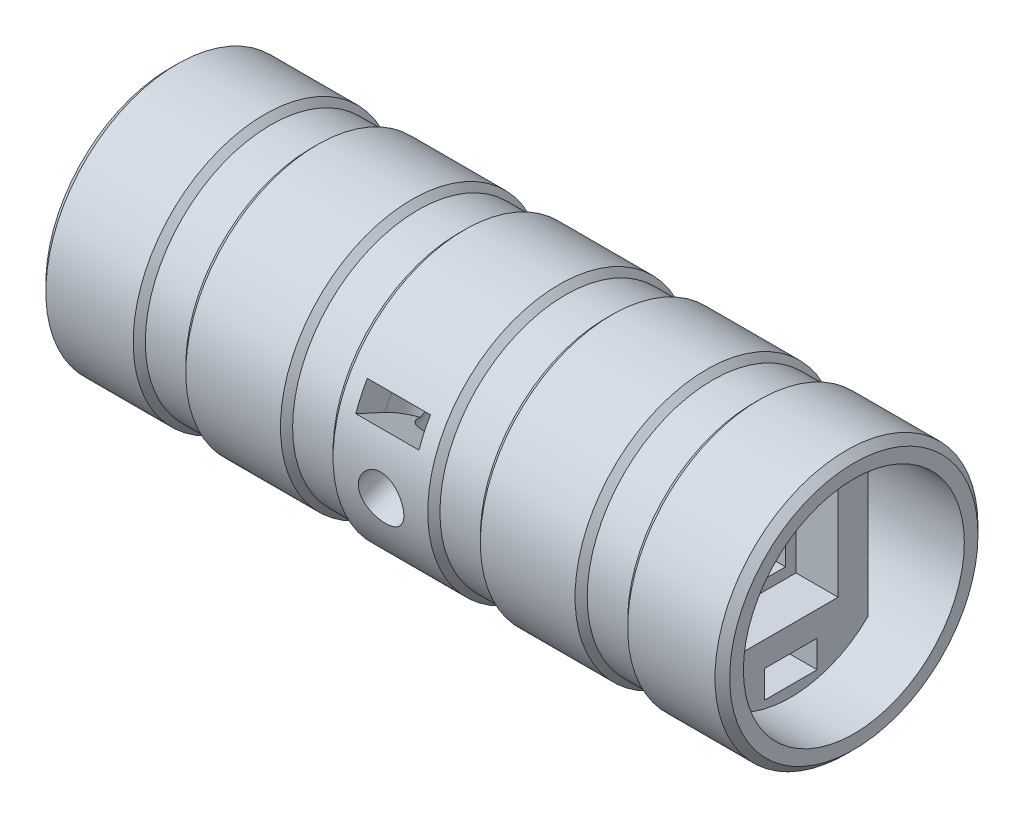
ISO-10303-21;
HEADER;
FILE_DESCRIPTION(('STEP AP214'),'2;1');
FILE_NAME('part.step','',(''),(''),'','','');
FILE_SCHEMA(('AUTOMOTIVE_DESIGN { 1 0 10303 214 1 1 1 1 }'));
ENDSEC;
DATA;
#1=APPLICATION_CONTEXT('core data for automotive mechanical design processes');
#2=APPLICATION_PROTOCOL_DEFINITION('international standard','automotive_design',2000,#1);
#3=PRODUCT_CONTEXT('',#1,'mechanical');
#4=PRODUCT('Part','Part','',(#3));
#5=PRODUCT_RELATED_PRODUCT_CATEGORY('part','',(#4));
#6=PRODUCT_DEFINITION_FORMATION('','',#4);
#7=PRODUCT_DEFINITION_CONTEXT('part definition',#1,'design');
#8=PRODUCT_DEFINITION('design','',#6,#7);
#9=PRODUCT_DEFINITION_SHAPE('','',#8);
#10=(LENGTH_UNIT() NAMED_UNIT(*) SI_UNIT(.MILLI.,.METRE.));
#11=(NAMED_UNIT(*) PLANE_ANGLE_UNIT() SI_UNIT($,.RADIAN.));
#12=(NAMED_UNIT(*) SI_UNIT($,.STERADIAN.) SOLID_ANGLE_UNIT());
#13=UNCERTAINTY_MEASURE_WITH_UNIT(LENGTH_MEASURE(1.E-05),#10,'distance_accuracy_value','');
#14=(GEOMETRIC_REPRESENTATION_CONTEXT(3) GLOBAL_UNCERTAINTY_ASSIGNED_CONTEXT((#13)) GLOBAL_UNIT_ASSIGNED_CONTEXT((#10,
#11,#12)) REPRESENTATION_CONTEXT('',''));
#15=CARTESIAN_POINT('',(0.,0.,0.));
#16=DIRECTION('',(0.,0.,1.));
#17=DIRECTION('',(1.,0.,0.));
#18=AXIS2_PLACEMENT_3D('',#15,#16,#17);
#19=CARTESIAN_POINT('',(0.,0.,0.));
#20=DIRECTION('',(1.,0.,0.));
#21=DIRECTION('',(0.,0.,-1.));
#22=AXIS2_PLACEMENT_3D('',#19,#20,#21);
#23=CYLINDRICAL_SURFACE('',#22,10.5);
#24=DIRECTION('',(1.,0.,0.));
#25=VECTOR('',#24,1.);
#26=CARTESIAN_POINT('',(0.,5.28579165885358,9.07250828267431));
#27=LINE('',#26,#25);
#28=CARTESIAN_POINT('',(29.5,5.28579165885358,9.07250828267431));
#29=VERTEX_POINT('',#28);
#30=CARTESIAN_POINT('',(20.7824781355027,5.28579165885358,9.07250828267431));
#31=VERTEX_POINT('',#30);
#32=EDGE_CURVE('E50',#29,#31,#27,.F.);
#33=ORIENTED_EDGE('',*,*,#32,.T.);
#34=CARTESIAN_POINT('',(27.5,0.,0.));
#35=DIRECTION('',(-0.707106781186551,0.241844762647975,-0.664463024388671));
#36=DIRECTION('',(0.707106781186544,0.241844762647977,-0.664463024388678));
#37=AXIS2_PLACEMENT_3D('',#34,#35,#36);
#38=ELLIPSE('',#37,14.8492424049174,10.5);
#39=CARTESIAN_POINT('',(17.1789002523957,-5.343630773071,9.03856239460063));
#40=VERTEX_POINT('',#39);
#41=EDGE_CURVE('E54',#31,#40,#38,.F.);
#42=ORIENTED_EDGE('',*,*,#41,.T.);
#43=DIRECTION('',(1.,0.,0.));
#44=VECTOR('',#43,1.);
#45=CARTESIAN_POINT('',(0.,-5.343630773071,9.03856239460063));
#46=LINE('',#45,#44);
#47=CARTESIAN_POINT('',(37.5,-5.343630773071,9.03856239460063));
#48=VERTEX_POINT('',#47);
#49=EDGE_CURVE('E806',#40,#48,#46,.T.);
#50=ORIENTED_EDGE('',*,*,#49,.T.);
#51=CARTESIAN_POINT('',(37.5,0.,0.));
#52=DIRECTION('',(1.,0.,0.));
#53=DIRECTION('',(0.,0.,-1.));
#54=AXIS2_PLACEMENT_3D('',#51,#52,#53);
#55=CIRCLE('',#54,10.5);
#56=CARTESIAN_POINT('',(37.5,1.57354504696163,10.3814236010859));
#57=VERTEX_POINT('',#56);
#58=EDGE_CURVE('E386',#48,#57,#55,.F.);
#59=ORIENTED_EDGE('',*,*,#58,.T.);
#60=DIRECTION('',(-1.,0.,0.));
#61=VECTOR('',#60,1.);
#62=CARTESIAN_POINT('',(45.5,1.57354504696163,10.3814236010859));
#63=LINE('',#62,#61);
#64=CARTESIAN_POINT('',(35.5,1.57354504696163,10.3814236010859));
#65=VERTEX_POINT('',#64);
#66=EDGE_CURVE('E1086',#57,#65,#63,.T.);
#67=ORIENTED_EDGE('',*,*,#66,.T.);
#68=CARTESIAN_POINT('',(35.5,0.,0.));
#69=DIRECTION('',(-1.,0.,0.));
#70=DIRECTION('',(0.,0.,1.));
#71=AXIS2_PLACEMENT_3D('',#68,#69,#70);
#72=CIRCLE('',#71,10.5);
#73=CARTESIAN_POINT('',(35.5,3.17935807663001,10.0070816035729));
#74=VERTEX_POINT('',#73);
#75=EDGE_CURVE('E1095',#65,#74,#72,.T.);
#76=ORIENTED_EDGE('',*,*,#75,.T.);
#77=CARTESIAN_POINT('',(35.5,0.,0.));
#78=DIRECTION('',(-1.,0.,0.));
#79=DIRECTION('',(0.,0.,1.));
#80=AXIS2_PLACEMENT_3D('',#77,#78,#79);
#81=CIRCLE('',#80,10.5);
#82=CARTESIAN_POINT('',(35.5,5.54623096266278,8.91567844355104));
#83=VERTEX_POINT('',#82);
#84=EDGE_CURVE('E875',#83,#74,#81,.F.);
#85=ORIENTED_EDGE('',*,*,#84,.F.);
#86=DIRECTION('',(1.,0.,0.));
#87=VECTOR('',#86,1.);
#88=CARTESIAN_POINT('',(0.,5.54623096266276,8.91567844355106));
#89=LINE('',#88,#87);
#90=CARTESIAN_POINT('',(29.5,5.54623096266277,8.91567844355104));
#91=VERTEX_POINT('',#90);
#92=EDGE_CURVE('E870',#91,#83,#89,.T.);
#93=ORIENTED_EDGE('',*,*,#92,.F.);
#94=CARTESIAN_POINT('',(29.5,0.,0.));
#95=DIRECTION('',(1.,0.,0.));
#96=DIRECTION('',(0.,0.,-1.));
#97=AXIS2_PLACEMENT_3D('',#94,#95,#96);
#98=CIRCLE('',#97,10.5);
#99=EDGE_CURVE('E866',#29,#91,#98,.F.);
#100=ORIENTED_EDGE('',*,*,#99,.F.);
#101=EDGE_LOOP('',(#33,#42,#50,#59,#67,#76,#85,#93,#100));
#102=FACE_BOUND('',#101,.T.);
#103=CARTESIAN_POINT('',(3.50000000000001,0.,0.));
#104=DIRECTION('',(-1.,0.,0.));
#105=DIRECTION('',(0.,0.,1.));
#106=AXIS2_PLACEMENT_3D('',#103,#104,#105);
#107=CIRCLE('',#106,10.5);
#108=CARTESIAN_POINT('',(3.50000000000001,0.,10.5));
#109=VERTEX_POINT('',#108);
#110=EDGE_CURVE('E590',#109,#109,#107,.T.);
#111=ORIENTED_EDGE('',*,*,#110,.T.);
#112=EDGE_LOOP('',(#111));
#113=FACE_BOUND('',#112,.T.);
#114=CARTESIAN_POINT('',(49.8999999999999,0.,0.));
#115=DIRECTION('',(1.,0.,0.));
#116=DIRECTION('',(0.,0.,-1.));
#117=AXIS2_PLACEMENT_3D('',#114,#115,#116);
#118=CIRCLE('',#117,10.5);
#119=CARTESIAN_POINT('',(49.8999999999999,8.87508813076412,-5.61095452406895));
#120=VERTEX_POINT('',#119);
#121=CARTESIAN_POINT('',(49.8999999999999,8.87508813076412,5.61095452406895));
#122=VERTEX_POINT('',#121);
#123=EDGE_CURVE('E610',#120,#122,#118,.T.);
#124=ORIENTED_EDGE('',*,*,#123,.T.);
#125=CARTESIAN_POINT('',(55.5109545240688,0.,0.));
#126=DIRECTION('',(-0.707106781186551,0.,-0.707106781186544));
#127=DIRECTION('',(0.707106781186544,0.,-0.707106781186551));
#128=AXIS2_PLACEMENT_3D('',#125,#126,#127);
#129=ELLIPSE('',#128,14.8492424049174,10.5);
#130=CARTESIAN_POINT('',(49.8999999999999,-8.87508813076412,5.61095452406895));
#131=VERTEX_POINT('',#130);
#132=EDGE_CURVE('E713',#122,#131,#129,.F.);
#133=ORIENTED_EDGE('',*,*,#132,.T.);
#134=CARTESIAN_POINT('',(49.8999999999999,0.,0.));
#135=DIRECTION('',(1.,0.,0.));
#136=DIRECTION('',(0.,0.,-1.));
#137=AXIS2_PLACEMENT_3D('',#134,#135,#136);
#138=CIRCLE('',#137,10.5);
#139=CARTESIAN_POINT('',(49.8999999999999,-8.87508813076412,-5.61095452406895));
#140=VERTEX_POINT('',#139);
#141=EDGE_CURVE('E613',#131,#140,#138,.T.);
#142=ORIENTED_EDGE('',*,*,#141,.T.);
#143=CARTESIAN_POINT('',(55.5109545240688,0.,0.));
#144=DIRECTION('',(0.707106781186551,0.,-0.707106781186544));
#145=DIRECTION('',(0.707106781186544,0.,0.707106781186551));
#146=AXIS2_PLACEMENT_3D('',#143,#144,#145);
#147=ELLIPSE('',#146,14.8492424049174,10.5);
#148=EDGE_CURVE('E663',#120,#140,#147,.F.);
#149=ORIENTED_EDGE('',*,*,#148,.F.);
#150=EDGE_LOOP('',(#124,#133,#142,#149));
#151=FACE_BOUND('',#150,.T.);
#152=CARTESIAN_POINT('',(31.4500534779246,0.,0.));
#153=DIRECTION('',(-0.663181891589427,-0.255987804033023,0.703320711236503));
#154=DIRECTION('',(0.748458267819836,-0.226821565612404,0.623187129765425));
#155=AXIS2_PLACEMENT_3D('',#152,#153,#154);
#156=ELLIPSE('',#155,15.8327604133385,10.5);
#157=CARTESIAN_POINT('',(19.8017974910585,1.71641725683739,-10.3587601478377));
#158=VERTEX_POINT('',#157);
#159=CARTESIAN_POINT('',(23.8687475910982,9.88084724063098,-3.552303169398));
#160=VERTEX_POINT('',#159);
#161=EDGE_CURVE('E355',#158,#160,#156,.F.);
#162=ORIENTED_EDGE('',*,*,#161,.T.);
#163=DIRECTION('',(1.,0.,0.));
#164=VECTOR('',#163,1.);
#165=CARTESIAN_POINT('',(0.,9.88084724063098,-3.552303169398));
#166=LINE('',#165,#164);
#167=CARTESIAN_POINT('',(37.5,9.88084724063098,-3.552303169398));
#168=VERTEX_POINT('',#167);
#169=EDGE_CURVE('E364',#160,#168,#166,.T.);
#170=ORIENTED_EDGE('',*,*,#169,.T.);
#171=CARTESIAN_POINT('',(37.5,1.71641725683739,-10.3587601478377));
#172=VERTEX_POINT('',#171);
#173=EDGE_CURVE('E383',#168,#172,#55,.F.);
#174=ORIENTED_EDGE('',*,*,#173,.T.);
#175=DIRECTION('',(1.,0.,0.));
#176=VECTOR('',#175,1.);
#177=CARTESIAN_POINT('',(0.,1.71641725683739,-10.3587601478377));
#178=LINE('',#177,#176);
#179=EDGE_CURVE('E789',#172,#158,#178,.F.);
#180=ORIENTED_EDGE('',*,*,#179,.T.);
#181=EDGE_LOOP('',(#162,#170,#174,#180));
#182=FACE_BOUND('',#181,.T.);
#183=ADVANCED_FACE('F34',(#102,#113,#151,#182),#23,.F.);
#184=CARTESIAN_POINT('',(27.5,1.8118067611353,-10.6208406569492));
#185=DIRECTION('',(-1.,0.,0.));
#186=DIRECTION('',(0.,0.,1.));
#187=AXIS2_PLACEMENT_3D('',#184,#185,#186);
#188=PLANE('',#187);
#189=DIRECTION('',(0.,-0.939692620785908,-0.34202014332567));
#190=VECTOR('',#189,1.);
#191=CARTESIAN_POINT('',(27.5,8.78038995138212,-0.528821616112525));
#192=LINE('',#191,#190);
#193=CARTESIAN_POINT('',(27.5,0.699033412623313,-3.47019484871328));
#194=VERTEX_POINT('',#193);
#195=CARTESIAN_POINT('',(27.5,-0.616536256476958,-3.94902304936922));
#196=VERTEX_POINT('',#195);
#197=EDGE_CURVE('E356',#194,#196,#192,.T.);
#198=ORIENTED_EDGE('',*,*,#197,.T.);
#199=DIRECTION('',(0.,-0.34202014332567,0.939692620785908));
#200=VECTOR('',#199,1.);
#201=CARTESIAN_POINT('',(27.5,1.8118067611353,-10.6208406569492));
#202=LINE('',#201,#200);
#203=CARTESIAN_POINT('',(27.5,-1.8136067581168,-0.660098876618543));
#204=VERTEX_POINT('',#203);
#205=EDGE_CURVE('E371',#196,#204,#202,.T.);
#206=ORIENTED_EDGE('',*,*,#205,.T.);
#207=DIRECTION('',(0.,-0.939692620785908,-0.34202014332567));
#208=VECTOR('',#207,1.);
#209=CARTESIAN_POINT('',(27.5,7.58331944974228,2.76010255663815));
#210=LINE('',#209,#208);
#211=CARTESIAN_POINT('',(27.5,-0.498037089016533,-0.181270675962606));
#212=VERTEX_POINT('',#211);
#213=EDGE_CURVE('E777',#212,#204,#210,.T.);
#214=ORIENTED_EDGE('',*,*,#213,.F.);
#215=DIRECTION('',(0.,-0.34202014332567,0.939692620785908));
#216=VECTOR('',#215,1.);
#217=CARTESIAN_POINT('',(27.5,3.12737643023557,-10.1420124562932));
#218=LINE('',#217,#216);
#219=EDGE_CURVE('E797',#194,#212,#218,.T.);
#220=ORIENTED_EDGE('',*,*,#219,.F.);
#221=EDGE_LOOP('',(#198,#206,#214,#220));
#222=FACE_BOUND('',#221,.T.);
#223=ADVANCED_FACE('F794',(#222),#188,.T.);
#224=CARTESIAN_POINT('',(65.,0.,0.));
#225=DIRECTION('',(-1.,0.,0.));
#226=DIRECTION('',(0.,0.,1.));
#227=AXIS2_PLACEMENT_3D('',#224,#225,#226);
#228=CYLINDRICAL_SURFACE('',#227,12.5);
#229=CARTESIAN_POINT('',(42.,0.,0.));
#230=DIRECTION('',(1.,0.,0.));
#231=DIRECTION('',(0.,0.,-1.));
#232=AXIS2_PLACEMENT_3D('',#229,#230,#231);
#233=CIRCLE('',#232,12.5);
#234=CARTESIAN_POINT('',(42.,0.,-12.5));
#235=VERTEX_POINT('',#234);
#236=EDGE_CURVE('E548',#235,#235,#233,.T.);
#237=ORIENTED_EDGE('',*,*,#236,.T.);
#238=EDGE_LOOP('',(#237));
#239=FACE_BOUND('',#238,.T.);
#240=CARTESIAN_POINT('',(51.,0.,0.));
#241=DIRECTION('',(1.,0.,0.));
#242=DIRECTION('',(0.,0.,-1.));
#243=AXIS2_PLACEMENT_3D('',#240,#241,#242);
#244=CIRCLE('',#243,12.5);
#245=CARTESIAN_POINT('',(51.,0.,-12.5));
#246=VERTEX_POINT('',#245);
#247=EDGE_CURVE('E539',#246,#246,#244,.F.);
#248=ORIENTED_EDGE('',*,*,#247,.T.);
#249=EDGE_LOOP('',(#248));
#250=FACE_BOUND('',#249,.T.);
#251=ADVANCED_FACE('F998',(#239,#250),#228,.T.);
#252=CARTESIAN_POINT('',(65.,0.,0.));
#253=DIRECTION('',(1.,0.,0.));
#254=DIRECTION('',(0.,0.,-1.));
#255=AXIS2_PLACEMENT_3D('',#252,#253,#254);
#256=CIRCLE('',#255,10.5);
#257=CARTESIAN_POINT('',(65.,0.,-10.5));
#258=VERTEX_POINT('',#257);
#259=EDGE_CURVE('E530',#258,#258,#256,.T.);
#260=ORIENTED_EDGE('',*,*,#259,.T.);
#261=EDGE_LOOP('',(#260));
#262=FACE_BOUND('',#261,.T.);
#263=DIRECTION('',(1.,0.,0.));
#264=VECTOR('',#263,1.);
#265=CARTESIAN_POINT('',(0.,-7.49902120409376,7.34946807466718));
#266=LINE('',#265,#264);
#267=CARTESIAN_POINT('',(53.,-7.49902120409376,7.34946807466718));
#268=VERTEX_POINT('',#267);
#269=CARTESIAN_POINT('',(59.,-7.49902120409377,7.34946807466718));
#270=VERTEX_POINT('',#269);
#271=EDGE_CURVE('E390',#268,#270,#266,.T.);
#272=ORIENTED_EDGE('',*,*,#271,.F.);
#273=CARTESIAN_POINT('',(53.,0.,0.));
#274=DIRECTION('',(1.,0.,0.));
#275=DIRECTION('',(0.,0.,-1.));
#276=AXIS2_PLACEMENT_3D('',#273,#274,#275);
#277=CIRCLE('',#276,10.5);
#278=CARTESIAN_POINT('',(53.,7.49902120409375,7.34946807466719));
#279=VERTEX_POINT('',#278);
#280=EDGE_CURVE('E743',#268,#279,#277,.F.);
#281=ORIENTED_EDGE('',*,*,#280,.T.);
#282=DIRECTION('',(1.,0.,0.));
#283=VECTOR('',#282,1.);
#284=CARTESIAN_POINT('',(0.,7.49902120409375,7.34946807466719));
#285=LINE('',#284,#283);
#286=CARTESIAN_POINT('',(59.,7.49902120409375,7.34946807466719));
#287=VERTEX_POINT('',#286);
#288=EDGE_CURVE('E392',#279,#287,#285,.T.);
#289=ORIENTED_EDGE('',*,*,#288,.T.);
#290=CARTESIAN_POINT('',(59.,0.,0.));
#291=DIRECTION('',(1.,0.,0.));
#292=DIRECTION('',(0.,0.,-1.));
#293=AXIS2_PLACEMENT_3D('',#290,#291,#292);
#294=CIRCLE('',#293,10.5);
#295=CARTESIAN_POINT('',(59.,7.49902120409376,-7.34946807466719));
#296=VERTEX_POINT('',#295);
#297=EDGE_CURVE('E521',#296,#287,#294,.T.);
#298=ORIENTED_EDGE('',*,*,#297,.F.);
#299=DIRECTION('',(1.,0.,0.));
#300=VECTOR('',#299,1.);
#301=CARTESIAN_POINT('',(0.,7.49902120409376,-7.34946807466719));
#302=LINE('',#301,#300);
#303=CARTESIAN_POINT('',(53.,7.49902120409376,-7.34946807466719));
#304=VERTEX_POINT('',#303);
#305=EDGE_CURVE('E401',#304,#296,#302,.T.);
#306=ORIENTED_EDGE('',*,*,#305,.F.);
#307=CARTESIAN_POINT('',(53.,0.,0.));
#308=DIRECTION('',(-1.,0.,0.));
#309=DIRECTION('',(0.,0.,1.));
#310=AXIS2_PLACEMENT_3D('',#307,#308,#309);
#311=CIRCLE('',#310,10.5);
#312=CARTESIAN_POINT('',(53.,-7.49902120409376,-7.34946807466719));
#313=VERTEX_POINT('',#312);
#314=EDGE_CURVE('E662',#313,#304,#311,.F.);
#315=ORIENTED_EDGE('',*,*,#314,.F.);
#316=DIRECTION('',(1.,0.,0.));
#317=VECTOR('',#316,1.);
#318=CARTESIAN_POINT('',(0.,-7.49902120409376,-7.34946807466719));
#319=LINE('',#318,#317);
#320=CARTESIAN_POINT('',(59.,-7.49902120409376,-7.34946807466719));
#321=VERTEX_POINT('',#320);
#322=EDGE_CURVE('E402',#313,#321,#319,.T.);
#323=ORIENTED_EDGE('',*,*,#322,.T.);
#324=EDGE_CURVE('E515',#270,#321,#294,.T.);
#325=ORIENTED_EDGE('',*,*,#324,.F.);
#326=EDGE_LOOP('',(#272,#281,#289,#298,#306,#315,#323,#325));
#327=FACE_BOUND('',#326,.T.);
#328=ADVANCED_FACE('F994',(#262,#327),#23,.F.);
#329=CARTESIAN_POINT('',(53.,0.,0.));
#330=DIRECTION('',(1.,0.,0.));
#331=DIRECTION('',(0.,0.,-1.));
#332=AXIS2_PLACEMENT_3D('',#329,#330,#331);
#333=PLANE('',#332);
#334=CARTESIAN_POINT('',(53.,0.,0.));
#335=DIRECTION('',(1.,0.,0.));
#336=DIRECTION('',(0.,0.,-1.));
#337=AXIS2_PLACEMENT_3D('',#334,#335,#336);
#338=CIRCLE('',#337,7.39999999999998);
#339=CARTESIAN_POINT('',(53.,-6.96883438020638,2.48904547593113));
#340=VERTEX_POINT('',#339);
#341=CARTESIAN_POINT('',(53.,-6.96097028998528,2.51095452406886));
#342=VERTEX_POINT('',#341);
#343=EDGE_CURVE('E607',#340,#342,#338,.F.);
#344=ORIENTED_EDGE('',*,*,#343,.T.);
#345=DIRECTION('',(0.,1.,0.));
#346=VECTOR('',#345,1.);
#347=CARTESIAN_POINT('',(53.,-12.5,2.51095452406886));
#348=LINE('',#347,#346);
#349=CARTESIAN_POINT('',(53.,-3.5,2.51095452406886));
#350=VERTEX_POINT('',#349);
#351=EDGE_CURVE('E739',#342,#350,#348,.T.);
#352=ORIENTED_EDGE('',*,*,#351,.T.);
#353=DIRECTION('',(0.,0.,1.));
#354=VECTOR('',#353,1.);
#355=CARTESIAN_POINT('',(53.,-3.5,-3.5));
#356=LINE('',#355,#354);
#357=CARTESIAN_POINT('',(53.,-3.5,-2.51095452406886));
#358=VERTEX_POINT('',#357);
#359=EDGE_CURVE('E413',#358,#350,#356,.T.);
#360=ORIENTED_EDGE('',*,*,#359,.F.);
#361=DIRECTION('',(0.,1.,0.));
#362=VECTOR('',#361,1.);
#363=CARTESIAN_POINT('',(53.,-12.5,-2.51095452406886));
#364=LINE('',#363,#362);
#365=CARTESIAN_POINT('',(53.,-6.8763295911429,-2.51095452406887));
#366=VERTEX_POINT('',#365);
#367=EDGE_CURVE('E716',#366,#358,#364,.T.);
#368=ORIENTED_EDGE('',*,*,#367,.F.);
#369=DIRECTION('',(0.,0.,1.));
#370=VECTOR('',#369,1.);
#371=CARTESIAN_POINT('',(53.,-6.87632959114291,2.48904547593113));
#372=LINE('',#371,#370);
#373=CARTESIAN_POINT('',(53.,-6.87632959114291,2.48904547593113));
#374=VERTEX_POINT('',#373);
#375=EDGE_CURVE('E451',#366,#374,#372,.T.);
#376=ORIENTED_EDGE('',*,*,#375,.T.);
#377=DIRECTION('',(0.,-1.,0.));
#378=VECTOR('',#377,1.);
#379=CARTESIAN_POINT('',(53.,-6.87632959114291,2.48904547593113));
#380=LINE('',#379,#378);
#381=EDGE_CURVE('E444',#374,#340,#380,.T.);
#382=ORIENTED_EDGE('',*,*,#381,.T.);
#383=EDGE_LOOP('',(#344,#352,#360,#368,#376,#382));
#384=FACE_BOUND('',#383,.T.);
#385=ADVANCED_FACE('F765',(#384),#333,.F.);
#386=CARTESIAN_POINT('',(52.,0.,0.));
#387=DIRECTION('',(1.,0.,0.));
#388=DIRECTION('',(0.,0.,-1.));
#389=AXIS2_PLACEMENT_3D('',#386,#387,#388);
#390=CYLINDRICAL_SURFACE('',#389,11.9217785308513);
#391=CARTESIAN_POINT('',(51.5782214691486,0.,0.));
#392=DIRECTION('',(-1.,0.,0.));
#393=DIRECTION('',(0.,0.,1.));
#394=AXIS2_PLACEMENT_3D('',#391,#392,#393);
#395=CIRCLE('',#394,11.9217785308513);
#396=CARTESIAN_POINT('',(51.5782214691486,0.,11.9217785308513));
#397=VERTEX_POINT('',#396);
#398=EDGE_CURVE('E545',#397,#397,#395,.F.);
#399=ORIENTED_EDGE('',*,*,#398,.T.);
#400=EDGE_LOOP('',(#399));
#401=FACE_BOUND('',#400,.T.);
#402=CARTESIAN_POINT('',(55.4217785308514,0.,0.));
#403=DIRECTION('',(1.,0.,0.));
#404=DIRECTION('',(0.,0.,-1.));
#405=AXIS2_PLACEMENT_3D('',#402,#403,#404);
#406=CIRCLE('',#405,11.9217785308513);
#407=CARTESIAN_POINT('',(55.4217785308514,0.,-11.9217785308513));
#408=VERTEX_POINT('',#407);
#409=EDGE_CURVE('E542',#408,#408,#406,.F.);
#410=ORIENTED_EDGE('',*,*,#409,.T.);
#411=EDGE_LOOP('',(#410));
#412=FACE_BOUND('',#411,.T.);
#413=ADVANCED_FACE('F1485',(#401,#412),#390,.T.);
#414=CARTESIAN_POINT('',(52.,0.,0.));
#415=DIRECTION('',(-1.,0.,0.));
#416=DIRECTION('',(0.,0.,1.));
#417=AXIS2_PLACEMENT_3D('',#414,#415,#416);
#418=CONICAL_SURFACE('',#417,11.5,0.785398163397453);
#419=ORIENTED_EDGE('',*,*,#247,.F.);
#420=EDGE_LOOP('',(#419));
#421=FACE_BOUND('',#420,.T.);
#422=ORIENTED_EDGE('',*,*,#398,.F.);
#423=EDGE_LOOP('',(#422));
#424=FACE_BOUND('',#423,.T.);
#425=ADVANCED_FACE('F1491',(#421,#424),#418,.T.);
#426=DIRECTION('',(0.,0.,-1.));
#427=VECTOR('',#426,1.);
#428=CARTESIAN_POINT('',(53.,3.5,-3.5));
#429=LINE('',#428,#427);
#430=CARTESIAN_POINT('',(53.,3.5,2.51095452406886));
#431=VERTEX_POINT('',#430);
#432=CARTESIAN_POINT('',(53.,3.5,-2.51095452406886));
#433=VERTEX_POINT('',#432);
#434=EDGE_CURVE('E408',#431,#433,#429,.T.);
#435=ORIENTED_EDGE('',*,*,#434,.F.);
#436=CARTESIAN_POINT('',(53.,6.96097028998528,2.51095452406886));
#437=VERTEX_POINT('',#436);
#438=EDGE_CURVE('E735',#431,#437,#348,.T.);
#439=ORIENTED_EDGE('',*,*,#438,.T.);
#440=CARTESIAN_POINT('',(53.,0.,0.));
#441=DIRECTION('',(1.,0.,0.));
#442=DIRECTION('',(0.,0.,-1.));
#443=AXIS2_PLACEMENT_3D('',#440,#441,#442);
#444=CIRCLE('',#443,7.39999999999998);
#445=CARTESIAN_POINT('',(53.,6.96883438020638,2.48904547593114));
#446=VERTEX_POINT('',#445);
#447=EDGE_CURVE('E605',#437,#446,#444,.F.);
#448=ORIENTED_EDGE('',*,*,#447,.T.);
#449=DIRECTION('',(0.,-1.,0.));
#450=VECTOR('',#449,1.);
#451=CARTESIAN_POINT('',(53.,6.87632959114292,2.48904547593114));
#452=LINE('',#451,#450);
#453=CARTESIAN_POINT('',(53.,6.87632959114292,2.48904547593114));
#454=VERTEX_POINT('',#453);
#455=EDGE_CURVE('E476',#446,#454,#452,.T.);
#456=ORIENTED_EDGE('',*,*,#455,.T.);
#457=DIRECTION('',(0.,0.,-1.));
#458=VECTOR('',#457,1.);
#459=CARTESIAN_POINT('',(53.,6.87632959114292,2.48904547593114));
#460=LINE('',#459,#458);
#461=CARTESIAN_POINT('',(53.,6.87632959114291,-2.51095452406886));
#462=VERTEX_POINT('',#461);
#463=EDGE_CURVE('E479',#454,#462,#460,.T.);
#464=ORIENTED_EDGE('',*,*,#463,.T.);
#465=EDGE_CURVE('E712',#433,#462,#364,.T.);
#466=ORIENTED_EDGE('',*,*,#465,.F.);
#467=EDGE_LOOP('',(#435,#439,#448,#456,#464,#466));
#468=FACE_BOUND('',#467,.T.);
#469=ADVANCED_FACE('F738',(#468),#333,.F.);
#470=CARTESIAN_POINT('',(0.,7.49902120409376,-7.34946807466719));
#471=DIRECTION('',(0.,0.,1.));
#472=DIRECTION('',(1.,0.,0.));
#473=AXIS2_PLACEMENT_3D('',#470,#471,#472);
#474=PLANE('',#473);
#475=DIRECTION('',(0.,-1.,0.));
#476=VECTOR('',#475,1.);
#477=CARTESIAN_POINT('',(53.,0.,-7.34946807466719));
#478=LINE('',#477,#476);
#479=EDGE_CURVE('E404',#304,#313,#478,.T.);
#480=ORIENTED_EDGE('',*,*,#479,.F.);
#481=ORIENTED_EDGE('',*,*,#305,.T.);
#482=DIRECTION('',(0.,-1.,0.));
#483=VECTOR('',#482,1.);
#484=CARTESIAN_POINT('',(59.,7.49902120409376,-7.34946807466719));
#485=LINE('',#484,#483);
#486=EDGE_CURVE('E398',#296,#321,#485,.T.);
#487=ORIENTED_EDGE('',*,*,#486,.T.);
#488=ORIENTED_EDGE('',*,*,#322,.F.);
#489=EDGE_LOOP('',(#480,#481,#487,#488));
#490=FACE_BOUND('',#489,.T.);
#491=ADVANCED_FACE('F637',(#490),#474,.F.);
#492=CARTESIAN_POINT('',(53.,0.,0.));
#493=DIRECTION('',(-1.,0.,0.));
#494=DIRECTION('',(0.,0.,1.));
#495=AXIS2_PLACEMENT_3D('',#492,#493,#494);
#496=CONICAL_SURFACE('',#495,7.39999999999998,0.785398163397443);
#497=ORIENTED_EDGE('',*,*,#141,.F.);
#498=CARTESIAN_POINT('',(49.3864471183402,-9.15361983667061,6.12450740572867));
#499=CARTESIAN_POINT('',(49.693151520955,-8.98973806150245,5.81780300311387));
#500=CARTESIAN_POINT('',(49.9988778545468,-8.82211047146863,5.51207666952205));
#501=CARTESIAN_POINT('',(50.6076323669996,-8.47807728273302,4.90332215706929));
#502=CARTESIAN_POINT('',(50.9106620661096,-8.30167705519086,4.60029245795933));
#503=CARTESIAN_POINT('',(51.513741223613,-7.93856460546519,3.99721330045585));
#504=CARTESIAN_POINT('',(51.8137897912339,-7.75184940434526,3.69716473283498));
#505=CARTESIAN_POINT('',(52.2610007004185,-7.46260027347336,3.24995382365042));
#506=CARTESIAN_POINT('',(52.4096392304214,-7.36462300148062,3.10131529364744));
#507=CARTESIAN_POINT('',(52.7057966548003,-7.16531596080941,2.80515786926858));
#508=CARTESIAN_POINT('',(52.853315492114,-7.06398602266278,2.6576390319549));
#509=CARTESIAN_POINT('',(53.0002,-6.96082981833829,2.51075452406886));
#510=B_SPLINE_CURVE_WITH_KNOTS('',3,(#498,#499,#500,#501,#502,#503,#504,#505,#506,#507,#508,
#509),.UNSPECIFIED.,.F.,.F.,(4,2,2,2,2,4),(0.,1.39104360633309,2.78124576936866,4.1718515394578,
4.8675819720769,5.56334762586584),.UNSPECIFIED.);
#511=EDGE_CURVE('E706',#131,#342,#510,.T.);
#512=ORIENTED_EDGE('',*,*,#511,.T.);
#513=ORIENTED_EDGE('',*,*,#343,.F.);
#514=CARTESIAN_POINT('',(50.6022364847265,-9.47632959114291,2.48904547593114));
#515=CARTESIAN_POINT('',(50.8032335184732,-9.26850586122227,2.48904547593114));
#516=CARTESIAN_POINT('',(51.0040192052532,-9.06047722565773,2.48904547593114));
#517=CARTESIAN_POINT('',(51.4050476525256,-8.64390167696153,2.48904547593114));
#518=CARTESIAN_POINT('',(51.6052904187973,-8.43535476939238,2.48904547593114));
#519=CARTESIAN_POINT('',(52.0051179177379,-8.01762891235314,2.48904547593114));
#520=CARTESIAN_POINT('',(52.2047026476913,-7.80844996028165,2.48904547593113));
#521=CARTESIAN_POINT('',(52.6030299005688,-7.38928765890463,2.48904547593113));
#522=CARTESIAN_POINT('',(52.8017724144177,-7.17930430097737,2.48904547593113));
#523=CARTESIAN_POINT('',(53.,-6.96883438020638,2.48904547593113));
#524=B_SPLINE_CURVE_WITH_KNOTS('',3,(#514,#515,#516,#517,#518,#519,#520,#521,#522,#523),
.UNSPECIFIED.,.F.,.F.,(4,2,2,2,4),(0.,0.867361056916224,1.73471284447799,2.60206820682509,
3.46943289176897),.UNSPECIFIED.);
#525=CARTESIAN_POINT('',(50.6022364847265,-9.47632959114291,2.48904547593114));
#526=VERTEX_POINT('',#525);
#527=EDGE_CURVE('E647',#526,#340,#524,.T.);
#528=ORIENTED_EDGE('',*,*,#527,.F.);
#529=CARTESIAN_POINT('',(50.5966477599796,-9.47632959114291,-2.51095452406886));
#530=CARTESIAN_POINT('',(50.6270053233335,-9.47632959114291,-2.39243620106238));
#531=CARTESIAN_POINT('',(50.6554739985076,-9.47632959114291,-2.27343943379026));
#532=CARTESIAN_POINT('',(50.7084244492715,-9.47632959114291,-2.03454773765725));
#533=CARTESIAN_POINT('',(50.7329057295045,-9.47632959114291,-1.9146526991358));
#534=CARTESIAN_POINT('',(50.8000671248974,-9.47632959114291,-1.55362870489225));
#535=CARTESIAN_POINT('',(50.8364330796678,-9.47632959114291,-1.31128312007));
#536=CARTESIAN_POINT('',(50.8904290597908,-9.47632959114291,-0.829118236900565));
#537=CARTESIAN_POINT('',(50.9083975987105,-9.47632959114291,-0.589336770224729));
#538=CARTESIAN_POINT('',(50.9260751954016,-9.47632959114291,-0.109184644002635));
#539=CARTESIAN_POINT('',(50.9257925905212,-9.47632959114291,0.131185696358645));
#540=CARTESIAN_POINT('',(50.9094648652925,-9.47632959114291,0.548551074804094));
#541=CARTESIAN_POINT('',(50.8975508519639,-9.47632959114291,0.725721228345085));
#542=CARTESIAN_POINT('',(50.8640449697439,-9.47632959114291,1.07914540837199));
#543=CARTESIAN_POINT('',(50.842453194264,-9.47632959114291,1.25539944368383));
#544=CARTESIAN_POINT('',(50.7896539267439,-9.47632959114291,1.60900851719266));
#545=CARTESIAN_POINT('',(50.75831417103,-9.47632959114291,1.78634361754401));
#546=CARTESIAN_POINT('',(50.6867673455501,-9.47632959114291,2.13916008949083));
#547=CARTESIAN_POINT('',(50.6465631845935,-9.47632959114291,2.31464204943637));
#548=CARTESIAN_POINT('',(50.6022364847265,-9.47632959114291,2.48904547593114));
#549=B_SPLINE_CURVE_WITH_KNOTS('',3,(#529,#530,#531,#532,#533,#534,#535,#536,#537,#538,#539,
#540,#541,#542,#543,#544,#545,#546,#547,#548),.UNSPECIFIED.,.F.,.F.,(4,2,2,2,2,2,2,2,2,4),(0.,
0.367003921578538,0.734053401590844,1.46853045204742,2.18923606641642,2.90961245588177,
3.44206844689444,3.9745192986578,4.51453534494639,5.0543744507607),.UNSPECIFIED.);
#550=CARTESIAN_POINT('',(50.5966477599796,-9.47632959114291,-2.51095452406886));
#551=VERTEX_POINT('',#550);
#552=EDGE_CURVE('E623',#551,#526,#549,.T.);
#553=ORIENTED_EDGE('',*,*,#552,.F.);
#554=CARTESIAN_POINT('',(53.,-6.96097028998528,-2.51095452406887));
#555=CARTESIAN_POINT('',(52.801345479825,-7.1721311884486,-2.51095452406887));
#556=CARTESIAN_POINT('',(52.602163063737,-7.38279379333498,-2.51095452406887));
#557=CARTESIAN_POINT('',(52.2029352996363,-7.80329549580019,-2.51095452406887));
#558=CARTESIAN_POINT('',(52.0028899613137,-8.01313460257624,-2.51095452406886));
#559=CARTESIAN_POINT('',(51.6021256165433,-8.43216620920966,-2.51095452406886));
#560=CARTESIAN_POINT('',(51.4014066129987,-8.64135871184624,-2.51095452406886));
#561=CARTESIAN_POINT('',(50.9994130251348,-9.05921380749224,-2.51095452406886));
#562=CARTESIAN_POINT('',(50.7981384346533,-9.26787639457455,-2.51095452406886));
#563=CARTESIAN_POINT('',(50.5966477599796,-9.47632959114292,-2.51095452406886));
#564=B_SPLINE_CURVE_WITH_KNOTS('',3,(#554,#555,#556,#557,#558,#559,#560,#561,#562,#563),
.UNSPECIFIED.,.F.,.F.,(4,2,2,2,4),(0.,0.869751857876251,1.73949397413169,2.60923234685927,
3.47898040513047),.UNSPECIFIED.);
#565=CARTESIAN_POINT('',(53.,-6.96097028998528,-2.51095452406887));
#566=VERTEX_POINT('',#565);
#567=EDGE_CURVE('E615',#566,#551,#564,.T.);
#568=ORIENTED_EDGE('',*,*,#567,.F.);
#569=CARTESIAN_POINT('',(48.507585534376,-9.61157347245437,-7.00336898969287));
#570=CARTESIAN_POINT('',(48.6985772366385,-9.51441961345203,-6.81237728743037));
#571=CARTESIAN_POINT('',(48.8892373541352,-9.41596970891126,-6.62171716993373));
#572=CARTESIAN_POINT('',(49.269820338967,-9.21624227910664,-6.24113418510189));
#573=CARTESIAN_POINT('',(49.459743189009,-9.11496468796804,-6.05121133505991));
#574=CARTESIAN_POINT('',(50.0279677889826,-8.80671406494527,-5.48298673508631));
#575=CARTESIAN_POINT('',(50.4050418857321,-8.5951631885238,-5.10591263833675));
#576=CARTESIAN_POINT('',(50.9675417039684,-8.2668378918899,-4.54341282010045));
#577=CARTESIAN_POINT('',(51.1545692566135,-8.15553388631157,-4.3563852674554));
#578=CARTESIAN_POINT('',(51.5273940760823,-7.92888584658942,-3.98356044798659));
#579=CARTESIAN_POINT('',(51.7131913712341,-7.81354190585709,-3.79776315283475));
#580=CARTESIAN_POINT('',(52.0835160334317,-7.57828775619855,-3.42743849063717));
#581=CARTESIAN_POINT('',(52.2680422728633,-7.45837398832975,-3.24291225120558));
#582=CARTESIAN_POINT('',(52.6354345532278,-7.21351192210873,-2.87551997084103));
#583=CARTESIAN_POINT('',(52.8183004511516,-7.08856319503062,-2.69265407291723));
#584=CARTESIAN_POINT('',(53.0002,-6.96082981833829,-2.51075452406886));
#585=B_SPLINE_CURVE_WITH_KNOTS('',3,(#569,#570,#571,#572,#573,#574,#575,#576,#577,#578,#579,
#580,#581,#582,#583,#584),.UNSPECIFIED.,.F.,.F.,(4,2,2,2,2,2,2,4),(0.,0.861123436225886,
1.72226695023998,3.44312905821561,4.30398879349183,5.16482863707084,6.0263531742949,
6.88795122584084),.UNSPECIFIED.);
#586=EDGE_CURVE('E654',#140,#566,#585,.T.);
#587=ORIENTED_EDGE('',*,*,#586,.F.);
#588=EDGE_LOOP('',(#497,#512,#513,#528,#553,#568,#587));
#589=FACE_BOUND('',#588,.T.);
#590=ADVANCED_FACE('F632',(#589),#496,.F.);
#591=CARTESIAN_POINT('',(53.,0.,0.));
#592=DIRECTION('',(-1.,0.,0.));
#593=DIRECTION('',(0.,0.,1.));
#594=AXIS2_PLACEMENT_3D('',#591,#592,#593);
#595=CONICAL_SURFACE('',#594,7.39999999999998,0.785398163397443);
#596=ORIENTED_EDGE('',*,*,#447,.F.);
#597=CARTESIAN_POINT('',(53.0002,6.96082981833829,2.51075452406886));
#598=CARTESIAN_POINT('',(52.8183004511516,7.08856319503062,2.69265407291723));
#599=CARTESIAN_POINT('',(52.6354345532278,7.21351192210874,2.87551997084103));
#600=CARTESIAN_POINT('',(52.2680422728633,7.45837398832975,3.24291225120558));
#601=CARTESIAN_POINT('',(52.0835160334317,7.57828775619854,3.42743849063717));
#602=CARTESIAN_POINT('',(51.7131913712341,7.81354190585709,3.79776315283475));
#603=CARTESIAN_POINT('',(51.5273940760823,7.92888584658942,3.98356044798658));
#604=CARTESIAN_POINT('',(51.1545692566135,8.15553388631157,4.35638526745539));
#605=CARTESIAN_POINT('',(50.9675417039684,8.2668378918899,4.54341282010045));
#606=CARTESIAN_POINT('',(50.4050418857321,8.5951631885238,5.10591263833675));
#607=CARTESIAN_POINT('',(50.0279677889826,8.80671406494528,5.48298673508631));
#608=CARTESIAN_POINT('',(49.459743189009,9.11496468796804,6.05121133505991));
#609=CARTESIAN_POINT('',(49.269820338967,9.21624227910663,6.24113418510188));
#610=CARTESIAN_POINT('',(48.8892373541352,9.41596970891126,6.62171716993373));
#611=CARTESIAN_POINT('',(48.6985772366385,9.51441961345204,6.81237728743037));
#612=CARTESIAN_POINT('',(48.5075855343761,9.6115734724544,7.00336898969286));
#613=B_SPLINE_CURVE_WITH_KNOTS('',3,(#597,#598,#599,#600,#601,#602,#603,#604,#605,#606,#607,
#608,#609,#610,#611,#612),.UNSPECIFIED.,.F.,.F.,(4,2,2,2,2,2,2,4),(0.,0.86159805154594,
1.72312258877,2.58396243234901,3.44482216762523,5.16568427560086,6.02682778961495,
6.88795122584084),.UNSPECIFIED.);
#614=EDGE_CURVE('E685',#437,#122,#613,.T.);
#615=ORIENTED_EDGE('',*,*,#614,.T.);
#616=ORIENTED_EDGE('',*,*,#123,.F.);
#617=CARTESIAN_POINT('',(53.0002,6.96082981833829,-2.51075452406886));
#618=CARTESIAN_POINT('',(52.8183004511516,7.08856319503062,-2.69265407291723));
#619=CARTESIAN_POINT('',(52.6354345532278,7.21351192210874,-2.87551997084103));
#620=CARTESIAN_POINT('',(52.2680422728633,7.45837398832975,-3.24291225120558));
#621=CARTESIAN_POINT('',(52.0835160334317,7.57828775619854,-3.42743849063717));
#622=CARTESIAN_POINT('',(51.7131913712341,7.81354190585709,-3.79776315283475));
#623=CARTESIAN_POINT('',(51.5273940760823,7.92888584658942,-3.98356044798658));
#624=CARTESIAN_POINT('',(51.1545692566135,8.15553388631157,-4.35638526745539));
#625=CARTESIAN_POINT('',(50.9675417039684,8.2668378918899,-4.54341282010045));
#626=CARTESIAN_POINT('',(50.4050418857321,8.5951631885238,-5.10591263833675));
#627=CARTESIAN_POINT('',(50.0279677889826,8.80671406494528,-5.48298673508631));
#628=CARTESIAN_POINT('',(49.459743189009,9.11496468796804,-6.05121133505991));
#629=CARTESIAN_POINT('',(49.269820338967,9.21624227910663,-6.24113418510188));
#630=CARTESIAN_POINT('',(48.8892373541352,9.41596970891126,-6.62171716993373));
#631=CARTESIAN_POINT('',(48.6985772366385,9.51441961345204,-6.81237728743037));
#632=CARTESIAN_POINT('',(48.5075855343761,9.6115734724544,-7.00336898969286));
#633=B_SPLINE_CURVE_WITH_KNOTS('',3,(#617,#618,#619,#620,#621,#622,#623,#624,#625,#626,#627,
#628,#629,#630,#631,#632),.UNSPECIFIED.,.F.,.F.,(4,2,2,2,2,2,2,4),(0.,0.86159805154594,
1.72312258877,2.58396243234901,3.44482216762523,5.16568427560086,6.02682778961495,
6.88795122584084),.UNSPECIFIED.);
#634=CARTESIAN_POINT('',(53.,6.96097028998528,-2.51095452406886));
#635=VERTEX_POINT('',#634);
#636=EDGE_CURVE('E678',#635,#120,#633,.T.);
#637=ORIENTED_EDGE('',*,*,#636,.F.);
#638=CARTESIAN_POINT('',(50.5966477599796,9.47632959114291,-2.51095452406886));
#639=CARTESIAN_POINT('',(50.7981384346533,9.26787639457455,-2.51095452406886));
#640=CARTESIAN_POINT('',(50.9994130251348,9.05921380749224,-2.51095452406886));
#641=CARTESIAN_POINT('',(51.4014066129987,8.64135871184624,-2.51095452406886));
#642=CARTESIAN_POINT('',(51.6021256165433,8.43216620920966,-2.51095452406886));
#643=CARTESIAN_POINT('',(52.0028899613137,8.01313460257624,-2.51095452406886));
#644=CARTESIAN_POINT('',(52.2029352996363,7.80329549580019,-2.51095452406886));
#645=CARTESIAN_POINT('',(52.602163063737,7.38279379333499,-2.51095452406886));
#646=CARTESIAN_POINT('',(52.801345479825,7.17213118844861,-2.51095452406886));
#647=CARTESIAN_POINT('',(53.,6.96097028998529,-2.51095452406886));
#648=B_SPLINE_CURVE_WITH_KNOTS('',3,(#638,#639,#640,#641,#642,#643,#644,#645,#646,#647),
.UNSPECIFIED.,.F.,.F.,(4,2,2,2,4),(0.,0.869748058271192,1.73948643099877,2.60922854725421,
3.47898040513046),.UNSPECIFIED.);
#649=CARTESIAN_POINT('',(50.5966477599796,9.47632959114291,-2.51095452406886));
#650=VERTEX_POINT('',#649);
#651=EDGE_CURVE('E929',#650,#635,#648,.T.);
#652=ORIENTED_EDGE('',*,*,#651,.F.);
#653=CARTESIAN_POINT('',(50.6022364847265,9.47632959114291,2.48904547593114));
#654=CARTESIAN_POINT('',(50.6323454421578,9.47632959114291,2.37053088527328));
#655=CARTESIAN_POINT('',(50.6605604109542,9.47632959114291,2.25154054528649));
#656=CARTESIAN_POINT('',(50.7129945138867,9.47632959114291,2.01266842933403));
#657=CARTESIAN_POINT('',(50.7372131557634,9.47632959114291,1.89278654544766));
#658=CARTESIAN_POINT('',(50.8035743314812,9.47632959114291,1.53181764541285));
#659=CARTESIAN_POINT('',(50.839391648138,9.47632959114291,1.28952578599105));
#660=CARTESIAN_POINT('',(50.8922891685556,9.47632959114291,0.807502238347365));
#661=CARTESIAN_POINT('',(50.9097077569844,9.47632959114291,0.567807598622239));
#662=CARTESIAN_POINT('',(50.9262946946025,9.47632959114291,0.0878699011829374));
#663=CARTESIAN_POINT('',(50.9254712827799,9.47632959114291,-0.152372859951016));
#664=CARTESIAN_POINT('',(50.9082205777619,9.47632959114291,-0.569703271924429));
#665=CARTESIAN_POINT('',(50.895905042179,9.47632959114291,-0.746974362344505));
#666=CARTESIAN_POINT('',(50.8615966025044,9.47632959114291,-1.10057902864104));
#667=CARTESIAN_POINT('',(50.8396037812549,9.47632959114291,-1.27691261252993));
#668=CARTESIAN_POINT('',(50.7860048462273,9.47632959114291,-1.63066370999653));
#669=CARTESIAN_POINT('',(50.7542665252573,9.47632959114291,-1.80806100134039));
#670=CARTESIAN_POINT('',(50.6819369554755,9.47632959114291,-2.16098491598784));
#671=CARTESIAN_POINT('',(50.6413486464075,9.47632959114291,-2.33651214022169));
#672=CARTESIAN_POINT('',(50.5966477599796,9.47632959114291,-2.51095452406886));
#673=B_SPLINE_CURVE_WITH_KNOTS('',3,(#653,#654,#655,#656,#657,#658,#659,#660,#661,#662,#663,
#664,#665,#666,#667,#668,#669,#670,#671,#672),.UNSPECIFIED.,.F.,.F.,(4,2,2,2,2,2,2,2,2,4),(0.,
0.36680856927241,0.733662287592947,1.46773573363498,2.18805982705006,2.90805859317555,
3.44089873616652,3.9737343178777,4.51414405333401,5.05437455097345),.UNSPECIFIED.);
#674=CARTESIAN_POINT('',(50.6022364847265,9.47632959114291,2.48904547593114));
#675=VERTEX_POINT('',#674);
#676=EDGE_CURVE('E1705',#675,#650,#673,.T.);
#677=ORIENTED_EDGE('',*,*,#676,.F.);
#678=CARTESIAN_POINT('',(53.,6.96883438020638,2.48904547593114));
#679=CARTESIAN_POINT('',(52.8017724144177,7.17930430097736,2.48904547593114));
#680=CARTESIAN_POINT('',(52.6030299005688,7.38928765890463,2.48904547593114));
#681=CARTESIAN_POINT('',(52.2047026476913,7.80844996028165,2.48904547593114));
#682=CARTESIAN_POINT('',(52.0051179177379,8.01762891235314,2.48904547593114));
#683=CARTESIAN_POINT('',(51.6052904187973,8.43535476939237,2.48904547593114));
#684=CARTESIAN_POINT('',(51.4050476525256,8.64390167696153,2.48904547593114));
#685=CARTESIAN_POINT('',(51.0040192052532,9.06047722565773,2.48904547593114));
#686=CARTESIAN_POINT('',(50.8032335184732,9.26850586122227,2.48904547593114));
#687=CARTESIAN_POINT('',(50.6022364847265,9.47632959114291,2.48904547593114));
#688=B_SPLINE_CURVE_WITH_KNOTS('',3,(#678,#679,#680,#681,#682,#683,#684,#685,#686,#687),
.UNSPECIFIED.,.F.,.F.,(4,2,2,2,4),(0.,0.867364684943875,1.73472004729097,2.60207183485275,
3.46943289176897),.UNSPECIFIED.);
#689=EDGE_CURVE('E1710',#446,#675,#688,.T.);
#690=ORIENTED_EDGE('',*,*,#689,.F.);
#691=EDGE_LOOP('',(#596,#615,#616,#637,#652,#677,#690));
#692=FACE_BOUND('',#691,.T.);
#693=ADVANCED_FACE('F636',(#692),#595,.F.);
#694=CARTESIAN_POINT('',(37.,0.,0.));
#695=DIRECTION('',(1.,0.,0.));
#696=DIRECTION('',(0.,0.,-1.));
#697=AXIS2_PLACEMENT_3D('',#694,#695,#696);
#698=CIRCLE('',#697,12.5);
#699=CARTESIAN_POINT('',(37.,0.,-12.5));
#700=VERTEX_POINT('',#699);
#701=EDGE_CURVE('E551',#700,#700,#698,.F.);
#702=ORIENTED_EDGE('',*,*,#701,.T.);
#703=EDGE_LOOP('',(#702));
#704=FACE_BOUND('',#703,.T.);
#705=CARTESIAN_POINT('',(28.,0.,0.));
#706=DIRECTION('',(1.,0.,0.));
#707=DIRECTION('',(0.,0.,-1.));
#708=AXIS2_PLACEMENT_3D('',#705,#706,#707);
#709=CIRCLE('',#708,12.5);
#710=CARTESIAN_POINT('',(28.,0.,-12.5));
#711=VERTEX_POINT('',#710);
#712=EDGE_CURVE('E560',#711,#711,#709,.T.);
#713=ORIENTED_EDGE('',*,*,#712,.T.);
#714=EDGE_LOOP('',(#713));
#715=FACE_BOUND('',#714,.T.);
#716=CARTESIAN_POINT('',(34.2804123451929,0.,12.5));
#717=CARTESIAN_POINT('',(34.2125792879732,0.106630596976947,12.4999993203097));
#718=CARTESIAN_POINT('',(34.1361547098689,0.207857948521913,12.4986265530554));
#719=CARTESIAN_POINT('',(33.9677192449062,0.396480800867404,12.4940678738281));
#720=CARTESIAN_POINT('',(33.8756976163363,0.483866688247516,12.4908807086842));
#721=CARTESIAN_POINT('',(33.6777917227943,0.641921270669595,12.4837584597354));
#722=CARTESIAN_POINT('',(33.5718686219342,0.712541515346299,12.4798212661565));
#723=CARTESIAN_POINT('',(33.3490687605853,0.833647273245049,12.4723189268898));
#724=CARTESIAN_POINT('',(33.2321988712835,0.884145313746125,12.4687535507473));
#725=CARTESIAN_POINT('',(32.9982072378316,0.960081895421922,12.4631302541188));
#726=CARTESIAN_POINT('',(32.8815142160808,0.986832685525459,12.4609952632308));
#727=CARTESIAN_POINT('',(32.645208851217,1.01879614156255,12.4584239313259));
#728=CARTESIAN_POINT('',(32.5255978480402,1.0240185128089,12.4579868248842));
#729=CARTESIAN_POINT('',(32.2956579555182,1.01305177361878,12.4588819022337));
#730=CARTESIAN_POINT('',(32.1852563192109,0.998310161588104,12.4600945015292));
#731=CARTESIAN_POINT('',(31.9684894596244,0.95065032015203,12.4638207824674));
#732=CARTESIAN_POINT('',(31.8621243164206,0.917731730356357,12.4663344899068));
#733=CARTESIAN_POINT('',(31.6554663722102,0.834890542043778,12.4721561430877));
#734=CARTESIAN_POINT('',(31.5552192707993,0.784854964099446,12.4754693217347));
#735=CARTESIAN_POINT('',(31.3637815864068,0.669754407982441,12.4821770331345));
#736=CARTESIAN_POINT('',(31.2725935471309,0.604685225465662,12.4855715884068));
#737=CARTESIAN_POINT('',(31.0948098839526,0.456435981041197,12.4918991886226));
#738=CARTESIAN_POINT('',(31.0090200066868,0.372288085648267,12.4947812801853));
#739=CARTESIAN_POINT('',(30.8514888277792,0.191694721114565,12.4988563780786));
#740=CARTESIAN_POINT('',(30.7797529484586,0.0952445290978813,12.500048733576));
#741=CARTESIAN_POINT('',(30.6469186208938,-0.114992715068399,12.4999445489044));
#742=CARTESIAN_POINT('',(30.5870147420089,-0.229536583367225,12.498455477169));
#743=CARTESIAN_POINT('',(30.4865021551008,-0.466719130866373,12.491847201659));
#744=CARTESIAN_POINT('',(30.4458969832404,-0.589359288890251,12.4867273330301));
#745=CARTESIAN_POINT('',(30.3845570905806,-0.842312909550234,12.4722454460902));
#746=CARTESIAN_POINT('',(30.3643020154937,-0.972738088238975,12.4627883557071));
#747=CARTESIAN_POINT('',(30.3463679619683,-1.23476096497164,12.4395598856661));
#748=CARTESIAN_POINT('',(30.3486849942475,-1.36635845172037,12.4257892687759));
#749=CARTESIAN_POINT('',(30.3759575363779,-1.62278353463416,12.3948683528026));
#750=CARTESIAN_POINT('',(30.4002383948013,-1.74769610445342,12.3778306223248));
#751=CARTESIAN_POINT('',(30.4702524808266,-1.990936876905,12.3410411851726));
#752=CARTESIAN_POINT('',(30.5159805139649,-2.10926666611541,12.3212901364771));
#753=CARTESIAN_POINT('',(30.6255613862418,-2.33105150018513,12.2812218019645));
#754=CARTESIAN_POINT('',(30.6886125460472,-2.43491307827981,12.2609591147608));
#755=CARTESIAN_POINT('',(30.8318240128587,-2.63011156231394,12.2205752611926));
#756=CARTESIAN_POINT('',(30.9119824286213,-2.72144985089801,12.2004540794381));
#757=CARTESIAN_POINT('',(31.0853995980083,-2.88737103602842,12.1622454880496));
#758=CARTESIAN_POINT('',(31.1783716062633,-2.96224658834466,12.1441260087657));
#759=CARTESIAN_POINT('',(31.3759318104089,-3.09551457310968,12.1108431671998));
#760=CARTESIAN_POINT('',(31.4805198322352,-3.15390725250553,12.0956797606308));
#761=CARTESIAN_POINT('',(31.6981706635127,-3.25266589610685,12.0694980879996));
#762=CARTESIAN_POINT('',(31.8112204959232,-3.2930588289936,12.0584736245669));
#763=CARTESIAN_POINT('',(32.0427345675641,-3.35497106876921,12.0413956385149));
#764=CARTESIAN_POINT('',(32.1611988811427,-3.37649011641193,12.035342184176));
#765=CARTESIAN_POINT('',(32.400518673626,-3.40017603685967,12.0286723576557));
#766=CARTESIAN_POINT('',(32.5213797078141,-3.40229091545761,12.0280705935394));
#767=CARTESIAN_POINT('',(32.7617592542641,-3.3869826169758,12.0323900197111));
#768=CARTESIAN_POINT('',(32.8812777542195,-3.36955926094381,12.0373112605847));
#769=CARTESIAN_POINT('',(33.1156777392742,-3.31556507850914,12.0522946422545));
#770=CARTESIAN_POINT('',(33.230555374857,-3.27897869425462,12.0623609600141));
#771=CARTESIAN_POINT('',(33.4522960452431,-3.18753551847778,12.0868459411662));
#772=CARTESIAN_POINT('',(33.5591591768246,-3.13267894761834,12.1012645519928));
#773=CARTESIAN_POINT('',(33.7616602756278,-3.00616789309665,12.1333090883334));
#774=CARTESIAN_POINT('',(33.8573155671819,-2.93453986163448,12.1509299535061));
#775=CARTESIAN_POINT('',(34.0348777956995,-2.77630449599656,12.188056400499));
#776=CARTESIAN_POINT('',(34.1167853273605,-2.68969781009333,12.2075619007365));
#777=CARTESIAN_POINT('',(34.2643982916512,-2.50408544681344,12.246979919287));
#778=CARTESIAN_POINT('',(34.3301442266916,-2.40511172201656,12.2668912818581));
#779=CARTESIAN_POINT('',(34.4440024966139,-2.19734532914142,12.3058047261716));
#780=CARTESIAN_POINT('',(34.4921154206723,-2.08855298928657,12.3248068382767));
#781=CARTESIAN_POINT('',(34.5698558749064,-1.86358641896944,12.3608285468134));
#782=CARTESIAN_POINT('',(34.5993827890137,-1.74737569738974,12.3778369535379));
#783=CARTESIAN_POINT('',(34.6391254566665,-1.51130277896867,12.4088734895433));
#784=CARTESIAN_POINT('',(34.6493361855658,-1.3914396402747,12.4229008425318));
#785=CARTESIAN_POINT('',(34.6506176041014,-1.14815824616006,12.4477737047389));
#786=CARTESIAN_POINT('',(34.6411852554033,-1.02472838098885,12.4585273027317));
#787=CARTESIAN_POINT('',(34.6028301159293,-0.780713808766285,12.4761950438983));
#788=CARTESIAN_POINT('',(34.5739157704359,-0.660127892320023,12.4831108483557));
#789=CARTESIAN_POINT('',(34.5048954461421,-0.447224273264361,12.4923622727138));
#790=CARTESIAN_POINT('',(34.4679602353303,-0.353889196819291,12.4953185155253));
#791=CARTESIAN_POINT('',(34.3826232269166,-0.172569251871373,12.4991376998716));
#792=CARTESIAN_POINT('',(34.3342208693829,-0.0845846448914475,12.5000005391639));
#793=CARTESIAN_POINT('',(34.2804123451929,0.,12.5));
#794=B_SPLINE_CURVE_WITH_KNOTS('',3,(#716,#717,#718,#719,#720,#721,#722,#723,#724,#725,#726,
#727,#728,#729,#730,#731,#732,#733,#734,#735,#736,#737,#738,#739,#740,#741,#742,#743,#744,#745,
#746,#747,#748,#749,#750,#751,#752,#753,#754,#755,#756,#757,#758,#759,#760,#761,#762,#763,#764,
#765,#766,#767,#768,#769,#770,#771,#772,#773,#774,#775,#776,#777,#778,#779,#780,#781,#782,#783,
#784,#785,#786,#787,#788,#789,#790,#791,#792,#793),.UNSPECIFIED.,.T.,.F.,(4,2,2,2,2,2,2,2,2,2,2,
2,2,2,2,2,2,2,2,2,2,2,2,2,2,2,2,2,2,2,2,2,2,2,2,2,2,2,4),(0.,0.378797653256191,
0.757857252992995,1.13799929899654,1.51790431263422,1.87520528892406,2.23234517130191,
2.56492922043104,2.89751986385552,3.2323495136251,3.56727291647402,3.92635563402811,
4.28557662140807,4.67162570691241,5.05774550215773,5.45276639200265,5.84771746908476,
6.23093425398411,6.61405827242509,6.98179540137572,7.34949189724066,7.70999999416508,
8.07050268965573,8.4304634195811,8.79042909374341,9.1513590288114,9.51229226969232,
9.87351899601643,10.2347413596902,10.5953977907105,10.9560386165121,11.3157662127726,
11.6754817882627,12.0371283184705,12.3988689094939,12.7699870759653,13.1409444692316,
13.4414107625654,13.7418917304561),.UNSPECIFIED.);
#795=CARTESIAN_POINT('',(34.2804123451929,0.,12.5));
#796=VERTEX_POINT('',#795);
#797=EDGE_CURVE('E391',#796,#796,#794,.T.);
#798=ORIENTED_EDGE('',*,*,#797,.F.);
#799=EDGE_LOOP('',(#798));
#800=FACE_BOUND('',#799,.T.);
#801=CARTESIAN_POINT('',(35.5,0.,0.));
#802=DIRECTION('',(-1.,0.,0.));
#803=DIRECTION('',(0.,0.,1.));
#804=AXIS2_PLACEMENT_3D('',#801,#802,#803);
#805=CIRCLE('',#804,12.5);
#806=CARTESIAN_POINT('',(35.5,4.0223139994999,11.8351590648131));
#807=VERTEX_POINT('',#806);
#808=CARTESIAN_POINT('',(35.5,6.3891868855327,10.7437559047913));
#809=VERTEX_POINT('',#808);
#810=EDGE_CURVE('E877',#807,#809,#805,.T.);
#811=ORIENTED_EDGE('',*,*,#810,.F.);
#812=DIRECTION('',(-1.,0.,0.));
#813=VECTOR('',#812,1.);
#814=CARTESIAN_POINT('',(65.,4.02231399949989,11.8351590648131));
#815=LINE('',#814,#813);
#816=CARTESIAN_POINT('',(29.5,4.02231399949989,11.8351590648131));
#817=VERTEX_POINT('',#816);
#818=EDGE_CURVE('E879',#817,#807,#815,.F.);
#819=ORIENTED_EDGE('',*,*,#818,.F.);
#820=CARTESIAN_POINT('',(29.5,0.,0.));
#821=DIRECTION('',(1.,0.,0.));
#822=DIRECTION('',(0.,0.,-1.));
#823=AXIS2_PLACEMENT_3D('',#820,#821,#822);
#824=CIRCLE('',#823,12.5);
#825=CARTESIAN_POINT('',(29.5,6.38918688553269,10.7437559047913));
#826=VERTEX_POINT('',#825);
#827=EDGE_CURVE('E868',#826,#817,#824,.T.);
#828=ORIENTED_EDGE('',*,*,#827,.F.);
#829=DIRECTION('',(-1.,0.,0.));
#830=VECTOR('',#829,1.);
#831=CARTESIAN_POINT('',(65.,6.38918688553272,10.7437559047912));
#832=LINE('',#831,#830);
#833=EDGE_CURVE('E873',#809,#826,#832,.T.);
#834=ORIENTED_EDGE('',*,*,#833,.F.);
#835=EDGE_LOOP('',(#811,#819,#828,#834));
#836=FACE_BOUND('',#835,.T.);
#837=ADVANCED_FACE('F952',(#704,#715,#800,#836),#228,.T.);
#838=CARTESIAN_POINT('',(27.5,11.2087329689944,-7.20063922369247));
#839=DIRECTION('',(0.,0.939692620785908,0.34202014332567));
#840=DIRECTION('',(0.,-0.34202014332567,0.939692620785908));
#841=AXIS2_PLACEMENT_3D('',#838,#839,#840);
#842=PLANE('',#841);
#843=DIRECTION('',(1.,0.,0.));
#844=VECTOR('',#843,1.);
#845=CARTESIAN_POINT('',(27.5,5.4325803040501,8.66920979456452));
#846=LINE('',#845,#844);
#847=CARTESIAN_POINT('',(29.5,5.4325803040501,8.66920979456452));
#848=VERTEX_POINT('',#847);
#849=CARTESIAN_POINT('',(37.5,5.43258030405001,8.66920979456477));
#850=VERTEX_POINT('',#849);
#851=EDGE_CURVE('E814',#848,#850,#846,.T.);
#852=ORIENTED_EDGE('',*,*,#851,.T.);
#853=DIRECTION('',(0.,-0.34202014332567,0.939692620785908));
#854=VECTOR('',#853,1.);
#855=CARTESIAN_POINT('',(37.5,11.2087329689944,-7.20063922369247));
#856=LINE('',#855,#854);
#857=EDGE_CURVE('E372',#168,#850,#856,.T.);
#858=ORIENTED_EDGE('',*,*,#857,.F.);
#859=ORIENTED_EDGE('',*,*,#169,.F.);
#860=DIRECTION('',(-0.748458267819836,0.226821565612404,-0.623187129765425));
#861=VECTOR('',#860,1.);
#862=CARTESIAN_POINT('',(27.5,8.78038995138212,-0.528821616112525));
#863=LINE('',#862,#861);
#864=CARTESIAN_POINT('',(27.5,8.78038995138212,-0.528821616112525));
#865=VERTEX_POINT('',#864);
#866=EDGE_CURVE('E347',#865,#160,#863,.T.);
#867=ORIENTED_EDGE('',*,*,#866,.F.);
#868=DIRECTION('',(0.,-0.34202014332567,0.939692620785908));
#869=VECTOR('',#868,1.);
#870=CARTESIAN_POINT('',(27.5,11.2087329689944,-7.20063922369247));
#871=LINE('',#870,#869);
#872=CARTESIAN_POINT('',(27.5,7.58331944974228,2.76010255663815));
#873=VERTEX_POINT('',#872);
#874=EDGE_CURVE('E361',#865,#873,#871,.T.);
#875=ORIENTED_EDGE('',*,*,#874,.T.);
#876=DIRECTION('',(0.707106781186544,0.241844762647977,-0.664463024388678));
#877=VECTOR('',#876,1.);
#878=CARTESIAN_POINT('',(27.5,7.58331944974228,2.76010255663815));
#879=LINE('',#878,#877);
#880=EDGE_CURVE('E781',#31,#873,#879,.T.);
#881=ORIENTED_EDGE('',*,*,#880,.F.);
#882=ORIENTED_EDGE('',*,*,#32,.F.);
#883=DIRECTION('',(0.,0.34202014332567,-0.939692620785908));
#884=VECTOR('',#883,1.);
#885=CARTESIAN_POINT('',(29.5,11.2087329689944,-7.20063922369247));
#886=LINE('',#885,#884);
#887=EDGE_CURVE('E811',#29,#848,#886,.T.);
#888=ORIENTED_EDGE('',*,*,#887,.T.);
#889=EDGE_LOOP('',(#852,#858,#859,#867,#875,#881,#882,#888));
#890=FACE_BOUND('',#889,.T.);
#891=ADVANCED_FACE('F359',(#890),#842,.T.);
#892=CARTESIAN_POINT('',(32.5,-2.59478844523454,16.1052021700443));
#893=DIRECTION('',(0.,0.34202014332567,-0.939692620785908));
#894=DIRECTION('',(0.,0.939692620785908,0.34202014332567));
#895=AXIS2_PLACEMENT_3D('',#892,#893,#894);
#896=CYLINDRICAL_SURFACE('',#895,2.15);
#897=CARTESIAN_POINT('',(32.5,1.33019111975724,5.3214094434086));
#898=DIRECTION('',(0.,-0.41874194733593,-0.90810527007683));
#899=DIRECTION('',(0.,0.90810527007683,-0.41874194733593));
#900=AXIS2_PLACEMENT_3D('',#897,#898,#899);
#901=ELLIPSE('',#900,3.02765030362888,2.15);
#902=CARTESIAN_POINT('',(33.8784123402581,3.44020713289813,4.3484471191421));
#903=VERTEX_POINT('',#902);
#904=CARTESIAN_POINT('',(34.6405971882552,1.0733342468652,5.43985027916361));
#905=VERTEX_POINT('',#904);
#906=EDGE_CURVE('E817',#903,#905,#901,.T.);
#907=ORIENTED_EDGE('',*,*,#906,.F.);
#908=CARTESIAN_POINT('',(32.5,2.4588945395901,2.22032228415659));
#909=DIRECTION('',(0.,-0.90810527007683,0.41874194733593));
#910=DIRECTION('',(0.,-0.41874194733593,-0.90810527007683));
#911=AXIS2_PLACEMENT_3D('',#908,#909,#910);
#912=ELLIPSE('',#911,3.05363455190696,2.15);
#913=CARTESIAN_POINT('',(31.6430904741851,3.63162905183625,4.76357451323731));
#914=VERTEX_POINT('',#913);
#915=EDGE_CURVE('E837',#903,#914,#912,.T.);
#916=ORIENTED_EDGE('',*,*,#915,.T.);
#917=CARTESIAN_POINT('',(31.6430904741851,3.63162905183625,4.76357451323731));
#918=CARTESIAN_POINT('',(31.6083065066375,3.60350697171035,4.7966224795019));
#919=CARTESIAN_POINT('',(31.5746236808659,3.57458331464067,4.83011464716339));
#920=CARTESIAN_POINT('',(31.5092986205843,3.51534460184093,4.89781103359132));
#921=CARTESIAN_POINT('',(31.4776554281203,3.48503021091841,4.93201490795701));
#922=CARTESIAN_POINT('',(31.3856308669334,3.39241350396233,5.03532528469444));
#923=CARTESIAN_POINT('',(31.3280027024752,3.32831187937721,5.10527770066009));
#924=CARTESIAN_POINT('',(31.2197301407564,3.19720196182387,5.24562049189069));
#925=CARTESIAN_POINT('',(31.1690079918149,3.1302395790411,5.31599467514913));
#926=CARTESIAN_POINT('',(31.0728942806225,2.99323004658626,5.45747715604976));
#927=CARTESIAN_POINT('',(31.0275065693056,2.92318071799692,5.52858594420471));
#928=CARTESIAN_POINT('',(30.9294707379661,2.76041348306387,5.69095814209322));
#929=CARTESIAN_POINT('',(30.8783502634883,2.66684221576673,5.78228757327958));
#930=CARTESIAN_POINT('',(30.7831225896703,2.47572162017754,5.9643769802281));
#931=CARTESIAN_POINT('',(30.7390144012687,2.37817285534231,6.05513703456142));
#932=CARTESIAN_POINT('',(30.6566511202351,2.1774521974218,6.23671026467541));
#933=CARTESIAN_POINT('',(30.6185041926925,2.07421421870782,6.32749977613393));
#934=CARTESIAN_POINT('',(30.5662600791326,1.91606007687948,6.46171193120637));
#935=CARTESIAN_POINT('',(30.5496743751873,1.86279102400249,6.50612179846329));
#936=CARTESIAN_POINT('',(30.5181957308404,1.75506797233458,6.59410484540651));
#937=CARTESIAN_POINT('',(30.5033029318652,1.70061387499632,6.63767795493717));
#938=CARTESIAN_POINT('',(30.4892747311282,1.64552833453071,6.68073973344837));
#939=B_SPLINE_CURVE_WITH_KNOTS('',3,(#917,#918,#919,#920,#921,#922,#923,#924,#925,#926,#927,
#928,#929,#930,#931,#932,#933,#934,#935,#936,#937,#938),.UNSPECIFIED.,.F.,.F.,(4,2,2,2,2,2,2,2,
2,2,4),(0.,0.166793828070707,0.333508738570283,0.666203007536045,0.994771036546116,
1.32357482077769,1.7444828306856,2.16533142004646,2.5930998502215,2.80699556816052,
3.02090914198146),.UNSPECIFIED.);
#940=CARTESIAN_POINT('',(30.4892747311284,1.64552833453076,6.68073973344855));
#941=VERTEX_POINT('',#940);
#942=EDGE_CURVE('E686',#914,#941,#939,.T.);
#943=ORIENTED_EDGE('',*,*,#942,.T.);
#944=CARTESIAN_POINT('',(32.5,1.19279157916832,5.69891157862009));
#945=DIRECTION('',(0.,0.90810527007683,-0.41874194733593));
#946=DIRECTION('',(0.,-0.41874194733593,-0.90810527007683));
#947=AXIS2_PLACEMENT_3D('',#944,#945,#946);
#948=ELLIPSE('',#947,3.05363455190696,2.15);
#949=EDGE_CURVE('E816',#941,#905,#948,.T.);
#950=ORIENTED_EDGE('',*,*,#949,.T.);
#951=EDGE_LOOP('',(#907,#916,#943,#950));
#952=FACE_BOUND('',#951,.T.);
#953=ORIENTED_EDGE('',*,*,#797,.T.);
#954=EDGE_LOOP('',(#953));
#955=FACE_BOUND('',#954,.T.);
#956=CARTESIAN_POINT('',(32.5,2.88485634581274,1.0500018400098));
#957=DIRECTION('',(0.,0.34202014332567,-0.939692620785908));
#958=DIRECTION('',(0.,0.939692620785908,0.34202014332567));
#959=AXIS2_PLACEMENT_3D('',#956,#957,#958);
#960=CIRCLE('',#959,2.15);
#961=CARTESIAN_POINT('',(32.5,4.90519548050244,1.78534514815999));
#962=VERTEX_POINT('',#961);
#963=EDGE_CURVE('E907',#962,#962,#960,.T.);
#964=ORIENTED_EDGE('',*,*,#963,.T.);
#965=EDGE_LOOP('',(#964));
#966=FACE_BOUND('',#965,.T.);
#967=ADVANCED_FACE('F835',(#952,#955,#966),#896,.F.);
#968=CARTESIAN_POINT('',(0.700000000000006,0.,0.));
#969=DIRECTION('',(1.,0.,0.));
#970=DIRECTION('',(0.,0.,-1.));
#971=AXIS2_PLACEMENT_3D('',#968,#969,#970);
#972=CIRCLE('',#971,12.5);
#973=CARTESIAN_POINT('',(0.700000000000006,0.,-12.5));
#974=VERTEX_POINT('',#973);
#975=EDGE_CURVE('E596',#974,#974,#972,.T.);
#976=ORIENTED_EDGE('',*,*,#975,.T.);
#977=EDGE_LOOP('',(#976));
#978=FACE_BOUND('',#977,.T.);
#979=CARTESIAN_POINT('',(8.99999999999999,0.,0.));
#980=DIRECTION('',(1.,0.,0.));
#981=DIRECTION('',(0.,0.,-1.));
#982=AXIS2_PLACEMENT_3D('',#979,#980,#981);
#983=CIRCLE('',#982,12.5);
#984=CARTESIAN_POINT('',(8.99999999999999,0.,-12.5));
#985=VERTEX_POINT('',#984);
#986=EDGE_CURVE('E575',#985,#985,#983,.F.);
#987=ORIENTED_EDGE('',*,*,#986,.T.);
#988=EDGE_LOOP('',(#987));
#989=FACE_BOUND('',#988,.T.);
#990=ADVANCED_FACE('F1220',(#978,#989),#228,.T.);
#991=CARTESIAN_POINT('',(23.,0.,0.));
#992=DIRECTION('',(1.,0.,0.));
#993=DIRECTION('',(0.,0.,-1.));
#994=AXIS2_PLACEMENT_3D('',#991,#992,#993);
#995=CIRCLE('',#994,12.5);
#996=CARTESIAN_POINT('',(23.,0.,-12.5));
#997=VERTEX_POINT('',#996);
#998=EDGE_CURVE('E563',#997,#997,#995,.F.);
#999=ORIENTED_EDGE('',*,*,#998,.T.);
#1000=EDGE_LOOP('',(#999));
#1001=FACE_BOUND('',#1000,.T.);
#1002=CARTESIAN_POINT('',(14.,0.,0.));
#1003=DIRECTION('',(1.,0.,0.));
#1004=DIRECTION('',(0.,0.,-1.));
#1005=AXIS2_PLACEMENT_3D('',#1002,#1003,#1004);
#1006=CIRCLE('',#1005,12.5);
#1007=CARTESIAN_POINT('',(14.,0.,-12.5));
#1008=VERTEX_POINT('',#1007);
#1009=EDGE_CURVE('E572',#1008,#1008,#1006,.T.);
#1010=ORIENTED_EDGE('',*,*,#1009,.T.);
#1011=EDGE_LOOP('',(#1010));
#1012=FACE_BOUND('',#1011,.T.);
#1013=ADVANCED_FACE('F1242',(#1001,#1012),#228,.T.);
#1014=CARTESIAN_POINT('',(64.3,0.,0.));
#1015=DIRECTION('',(1.,0.,0.));
#1016=DIRECTION('',(0.,0.,-1.));
#1017=AXIS2_PLACEMENT_3D('',#1014,#1015,#1016);
#1018=CIRCLE('',#1017,12.5);
#1019=CARTESIAN_POINT('',(64.3,0.,-12.5));
#1020=VERTEX_POINT('',#1019);
#1021=EDGE_CURVE('E587',#1020,#1020,#1018,.F.);
#1022=ORIENTED_EDGE('',*,*,#1021,.T.);
#1023=EDGE_LOOP('',(#1022));
#1024=FACE_BOUND('',#1023,.T.);
#1025=CARTESIAN_POINT('',(56.,0.,0.));
#1026=DIRECTION('',(1.,0.,0.));
#1027=DIRECTION('',(0.,0.,-1.));
#1028=AXIS2_PLACEMENT_3D('',#1025,#1026,#1027);
#1029=CIRCLE('',#1028,12.5);
#1030=CARTESIAN_POINT('',(56.,0.,-12.5));
#1031=VERTEX_POINT('',#1030);
#1032=EDGE_CURVE('E534',#1031,#1031,#1029,.T.);
#1033=ORIENTED_EDGE('',*,*,#1032,.T.);
#1034=EDGE_LOOP('',(#1033));
#1035=FACE_BOUND('',#1034,.T.);
#1036=ADVANCED_FACE('F1251',(#1024,#1035),#228,.T.);
#1037=CARTESIAN_POINT('',(65.,0.,0.));
#1038=DIRECTION('',(1.,0.,0.));
#1039=DIRECTION('',(0.,0.,-1.));
#1040=AXIS2_PLACEMENT_3D('',#1037,#1038,#1039);
#1041=PLANE('',#1040);
#1042=CARTESIAN_POINT('',(65.,0.,0.));
#1043=DIRECTION('',(1.,0.,0.));
#1044=DIRECTION('',(0.,0.,-1.));
#1045=AXIS2_PLACEMENT_3D('',#1042,#1043,#1044);
#1046=CIRCLE('',#1045,11.8);
#1047=CARTESIAN_POINT('',(65.,0.,-11.8));
#1048=VERTEX_POINT('',#1047);
#1049=EDGE_CURVE('E584',#1048,#1048,#1046,.T.);
#1050=ORIENTED_EDGE('',*,*,#1049,.T.);
#1051=EDGE_LOOP('',(#1050));
#1052=FACE_BOUND('',#1051,.T.);
#1053=ORIENTED_EDGE('',*,*,#259,.F.);
#1054=EDGE_LOOP('',(#1053));
#1055=FACE_BOUND('',#1054,.T.);
#1056=ADVANCED_FACE('F1012',(#1052,#1055),#1041,.T.);
#1057=CARTESIAN_POINT('',(0.,0.,0.));
#1058=DIRECTION('',(1.,0.,0.));
#1059=DIRECTION('',(0.,0.,-1.));
#1060=AXIS2_PLACEMENT_3D('',#1057,#1058,#1059);
#1061=PLANE('',#1060);
#1062=CARTESIAN_POINT('',(0.,0.,0.));
#1063=DIRECTION('',(1.,0.,0.));
#1064=DIRECTION('',(0.,0.,-1.));
#1065=AXIS2_PLACEMENT_3D('',#1062,#1063,#1064);
#1066=CIRCLE('',#1065,11.8);
#1067=CARTESIAN_POINT('',(0.,0.,-11.8));
#1068=VERTEX_POINT('',#1067);
#1069=EDGE_CURVE('E599',#1068,#1068,#1066,.F.);
#1070=ORIENTED_EDGE('',*,*,#1069,.T.);
#1071=EDGE_LOOP('',(#1070));
#1072=FACE_BOUND('',#1071,.T.);
#1073=CARTESIAN_POINT('',(0.,0.,0.));
#1074=DIRECTION('',(1.,0.,0.));
#1075=DIRECTION('',(0.,0.,-1.));
#1076=AXIS2_PLACEMENT_3D('',#1073,#1074,#1075);
#1077=CIRCLE('',#1076,10.5);
#1078=CARTESIAN_POINT('',(0.,0.,-10.5));
#1079=VERTEX_POINT('',#1078);
#1080=EDGE_CURVE('E531',#1079,#1079,#1077,.T.);
#1081=ORIENTED_EDGE('',*,*,#1080,.T.);
#1082=EDGE_LOOP('',(#1081));
#1083=FACE_BOUND('',#1082,.T.);
#1084=ADVANCED_FACE('F1003',(#1072,#1083),#1061,.F.);
#1085=ORIENTED_EDGE('',*,*,#1080,.F.);
#1086=EDGE_LOOP('',(#1085));
#1087=FACE_BOUND('',#1086,.T.);
#1088=CARTESIAN_POINT('',(1.4,0.,0.));
#1089=DIRECTION('',(-1.,0.,0.));
#1090=DIRECTION('',(0.,0.,1.));
#1091=AXIS2_PLACEMENT_3D('',#1088,#1089,#1090);
#1092=CIRCLE('',#1091,10.5);
#1093=CARTESIAN_POINT('',(1.4,0.,10.5));
#1094=VERTEX_POINT('',#1093);
#1095=EDGE_CURVE('E524',#1094,#1094,#1092,.T.);
#1096=ORIENTED_EDGE('',*,*,#1095,.F.);
#1097=EDGE_LOOP('',(#1096));
#1098=FACE_BOUND('',#1097,.T.);
#1099=ADVANCED_FACE('F934',(#1087,#1098),#23,.F.);
#1100=CARTESIAN_POINT('',(56.,0.,0.));
#1101=DIRECTION('',(1.,0.,0.));
#1102=DIRECTION('',(0.,0.,-1.));
#1103=AXIS2_PLACEMENT_3D('',#1100,#1101,#1102);
#1104=CONICAL_SURFACE('',#1103,12.5,0.785398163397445);
#1105=ORIENTED_EDGE('',*,*,#409,.F.);
#1106=EDGE_LOOP('',(#1105));
#1107=FACE_BOUND('',#1106,.T.);
#1108=ORIENTED_EDGE('',*,*,#1032,.F.);
#1109=EDGE_LOOP('',(#1108));
#1110=FACE_BOUND('',#1109,.T.);
#1111=ADVANCED_FACE('F1002',(#1107,#1110),#1104,.T.);
#1112=CARTESIAN_POINT('',(38.,0.,0.));
#1113=DIRECTION('',(1.,0.,0.));
#1114=DIRECTION('',(0.,0.,-1.));
#1115=AXIS2_PLACEMENT_3D('',#1112,#1113,#1114);
#1116=CYLINDRICAL_SURFACE('',#1115,11.9217785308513);
#1117=CARTESIAN_POINT('',(37.5782214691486,0.,0.));
#1118=DIRECTION('',(-1.,0.,0.));
#1119=DIRECTION('',(0.,0.,1.));
#1120=AXIS2_PLACEMENT_3D('',#1117,#1118,#1119);
#1121=CIRCLE('',#1120,11.9217785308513);
#1122=CARTESIAN_POINT('',(37.5782214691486,0.,11.9217785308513));
#1123=VERTEX_POINT('',#1122);
#1124=EDGE_CURVE('E557',#1123,#1123,#1121,.F.);
#1125=ORIENTED_EDGE('',*,*,#1124,.T.);
#1126=EDGE_LOOP('',(#1125));
#1127=FACE_BOUND('',#1126,.T.);
#1128=CARTESIAN_POINT('',(41.4217785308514,0.,0.));
#1129=DIRECTION('',(1.,0.,0.));
#1130=DIRECTION('',(0.,0.,-1.));
#1131=AXIS2_PLACEMENT_3D('',#1128,#1129,#1130);
#1132=CIRCLE('',#1131,11.9217785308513);
#1133=CARTESIAN_POINT('',(41.4217785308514,0.,-11.9217785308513));
#1134=VERTEX_POINT('',#1133);
#1135=EDGE_CURVE('E554',#1134,#1134,#1132,.F.);
#1136=ORIENTED_EDGE('',*,*,#1135,.T.);
#1137=EDGE_LOOP('',(#1136));
#1138=FACE_BOUND('',#1137,.T.);
#1139=ADVANCED_FACE('F1009',(#1127,#1138),#1116,.T.);
#1140=CARTESIAN_POINT('',(24.,0.,0.));
#1141=DIRECTION('',(1.,0.,0.));
#1142=DIRECTION('',(0.,0.,-1.));
#1143=AXIS2_PLACEMENT_3D('',#1140,#1141,#1142);
#1144=CYLINDRICAL_SURFACE('',#1143,11.9217785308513);
#1145=CARTESIAN_POINT('',(27.4217785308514,0.,0.));
#1146=DIRECTION('',(1.,0.,0.));
#1147=DIRECTION('',(0.,0.,-1.));
#1148=AXIS2_PLACEMENT_3D('',#1145,#1146,#1147);
#1149=CIRCLE('',#1148,11.9217785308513);
#1150=CARTESIAN_POINT('',(27.4217785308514,0.,-11.9217785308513));
#1151=VERTEX_POINT('',#1150);
#1152=EDGE_CURVE('E566',#1151,#1151,#1149,.F.);
#1153=ORIENTED_EDGE('',*,*,#1152,.T.);
#1154=EDGE_LOOP('',(#1153));
#1155=FACE_BOUND('',#1154,.T.);
#1156=CARTESIAN_POINT('',(23.5782214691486,0.,0.));
#1157=DIRECTION('',(-1.,0.,0.));
#1158=DIRECTION('',(0.,0.,1.));
#1159=AXIS2_PLACEMENT_3D('',#1156,#1157,#1158);
#1160=CIRCLE('',#1159,11.9217785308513);
#1161=CARTESIAN_POINT('',(23.5782214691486,0.,11.9217785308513));
#1162=VERTEX_POINT('',#1161);
#1163=EDGE_CURVE('E569',#1162,#1162,#1160,.F.);
#1164=ORIENTED_EDGE('',*,*,#1163,.T.);
#1165=EDGE_LOOP('',(#1164));
#1166=FACE_BOUND('',#1165,.T.);
#1167=ADVANCED_FACE('F1555',(#1155,#1166),#1144,.T.);
#1168=CARTESIAN_POINT('',(10.,0.,0.));
#1169=DIRECTION('',(1.,0.,0.));
#1170=DIRECTION('',(0.,0.,-1.));
#1171=AXIS2_PLACEMENT_3D('',#1168,#1169,#1170);
#1172=CYLINDRICAL_SURFACE('',#1171,11.9217785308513);
#1173=CARTESIAN_POINT('',(9.57822146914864,0.,0.));
#1174=DIRECTION('',(-1.,0.,0.));
#1175=DIRECTION('',(0.,0.,1.));
#1176=AXIS2_PLACEMENT_3D('',#1173,#1174,#1175);
#1177=CIRCLE('',#1176,11.9217785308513);
#1178=CARTESIAN_POINT('',(9.57822146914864,0.,11.9217785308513));
#1179=VERTEX_POINT('',#1178);
#1180=EDGE_CURVE('E581',#1179,#1179,#1177,.F.);
#1181=ORIENTED_EDGE('',*,*,#1180,.T.);
#1182=EDGE_LOOP('',(#1181));
#1183=FACE_BOUND('',#1182,.T.);
#1184=CARTESIAN_POINT('',(13.4217785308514,0.,0.));
#1185=DIRECTION('',(1.,0.,0.));
#1186=DIRECTION('',(0.,0.,-1.));
#1187=AXIS2_PLACEMENT_3D('',#1184,#1185,#1186);
#1188=CIRCLE('',#1187,11.9217785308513);
#1189=CARTESIAN_POINT('',(13.4217785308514,0.,-11.9217785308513));
#1190=VERTEX_POINT('',#1189);
#1191=EDGE_CURVE('E578',#1190,#1190,#1188,.F.);
#1192=ORIENTED_EDGE('',*,*,#1191,.T.);
#1193=EDGE_LOOP('',(#1192));
#1194=FACE_BOUND('',#1193,.T.);
#1195=ADVANCED_FACE('F1561',(#1183,#1194),#1172,.T.);
#1196=CARTESIAN_POINT('',(42.,0.,0.));
#1197=DIRECTION('',(1.,0.,0.));
#1198=DIRECTION('',(0.,0.,-1.));
#1199=AXIS2_PLACEMENT_3D('',#1196,#1197,#1198);
#1200=CONICAL_SURFACE('',#1199,12.5,0.785398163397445);
#1201=ORIENTED_EDGE('',*,*,#1135,.F.);
#1202=EDGE_LOOP('',(#1201));
#1203=FACE_BOUND('',#1202,.T.);
#1204=ORIENTED_EDGE('',*,*,#236,.F.);
#1205=EDGE_LOOP('',(#1204));
#1206=FACE_BOUND('',#1205,.T.);
#1207=ADVANCED_FACE('F1205',(#1203,#1206),#1200,.T.);
#1208=CARTESIAN_POINT('',(38.,0.,0.));
#1209=DIRECTION('',(-1.,0.,0.));
#1210=DIRECTION('',(0.,0.,1.));
#1211=AXIS2_PLACEMENT_3D('',#1208,#1209,#1210);
#1212=CONICAL_SURFACE('',#1211,11.5,0.785398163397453);
#1213=ORIENTED_EDGE('',*,*,#701,.F.);
#1214=EDGE_LOOP('',(#1213));
#1215=FACE_BOUND('',#1214,.T.);
#1216=ORIENTED_EDGE('',*,*,#1124,.F.);
#1217=EDGE_LOOP('',(#1216));
#1218=FACE_BOUND('',#1217,.T.);
#1219=ADVANCED_FACE('F1200',(#1215,#1218),#1212,.T.);
#1220=CARTESIAN_POINT('',(28.,0.,0.));
#1221=DIRECTION('',(1.,0.,0.));
#1222=DIRECTION('',(0.,0.,-1.));
#1223=AXIS2_PLACEMENT_3D('',#1220,#1221,#1222);
#1224=CONICAL_SURFACE('',#1223,12.5,0.785398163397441);
#1225=ORIENTED_EDGE('',*,*,#1152,.F.);
#1226=EDGE_LOOP('',(#1225));
#1227=FACE_BOUND('',#1226,.T.);
#1228=ORIENTED_EDGE('',*,*,#712,.F.);
#1229=EDGE_LOOP('',(#1228));
#1230=FACE_BOUND('',#1229,.T.);
#1231=ADVANCED_FACE('F1204',(#1227,#1230),#1224,.T.);
#1232=CARTESIAN_POINT('',(24.,0.,0.));
#1233=DIRECTION('',(-1.,0.,0.));
#1234=DIRECTION('',(0.,0.,1.));
#1235=AXIS2_PLACEMENT_3D('',#1232,#1233,#1234);
#1236=CONICAL_SURFACE('',#1235,11.5,0.785398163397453);
#1237=ORIENTED_EDGE('',*,*,#1163,.F.);
#1238=EDGE_LOOP('',(#1237));
#1239=FACE_BOUND('',#1238,.T.);
#1240=ORIENTED_EDGE('',*,*,#998,.F.);
#1241=EDGE_LOOP('',(#1240));
#1242=FACE_BOUND('',#1241,.T.);
#1243=ADVANCED_FACE('F1573',(#1239,#1242),#1236,.T.);
#1244=CARTESIAN_POINT('',(14.,0.,0.));
#1245=DIRECTION('',(1.,0.,0.));
#1246=DIRECTION('',(0.,0.,-1.));
#1247=AXIS2_PLACEMENT_3D('',#1244,#1245,#1246);
#1248=CONICAL_SURFACE('',#1247,12.5,0.785398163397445);
#1249=ORIENTED_EDGE('',*,*,#1191,.F.);
#1250=EDGE_LOOP('',(#1249));
#1251=FACE_BOUND('',#1250,.T.);
#1252=ORIENTED_EDGE('',*,*,#1009,.F.);
#1253=EDGE_LOOP('',(#1252));
#1254=FACE_BOUND('',#1253,.T.);
#1255=ADVANCED_FACE('F1585',(#1251,#1254),#1248,.T.);
#1256=CARTESIAN_POINT('',(9.99999999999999,0.,0.));
#1257=DIRECTION('',(-1.,0.,0.));
#1258=DIRECTION('',(0.,0.,1.));
#1259=AXIS2_PLACEMENT_3D('',#1256,#1257,#1258);
#1260=CONICAL_SURFACE('',#1259,11.5,0.785398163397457);
#1261=ORIENTED_EDGE('',*,*,#986,.F.);
#1262=EDGE_LOOP('',(#1261));
#1263=FACE_BOUND('',#1262,.T.);
#1264=ORIENTED_EDGE('',*,*,#1180,.F.);
#1265=EDGE_LOOP('',(#1264));
#1266=FACE_BOUND('',#1265,.T.);
#1267=ADVANCED_FACE('F1598',(#1263,#1266),#1260,.T.);
#1268=CARTESIAN_POINT('',(65.,0.,0.));
#1269=DIRECTION('',(-1.,0.,0.));
#1270=DIRECTION('',(0.,0.,1.));
#1271=AXIS2_PLACEMENT_3D('',#1268,#1269,#1270);
#1272=CONICAL_SURFACE('',#1271,11.8,0.785398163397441);
#1273=ORIENTED_EDGE('',*,*,#1021,.F.);
#1274=EDGE_LOOP('',(#1273));
#1275=FACE_BOUND('',#1274,.T.);
#1276=ORIENTED_EDGE('',*,*,#1049,.F.);
#1277=EDGE_LOOP('',(#1276));
#1278=FACE_BOUND('',#1277,.T.);
#1279=ADVANCED_FACE('F1605',(#1275,#1278),#1272,.T.);
#1280=CARTESIAN_POINT('',(2.8,0.,0.));
#1281=DIRECTION('',(-1.,0.,0.));
#1282=DIRECTION('',(0.,0.,1.));
#1283=AXIS2_PLACEMENT_3D('',#1280,#1281,#1282);
#1284=CYLINDRICAL_SURFACE('',#1283,11.1);
#1285=CARTESIAN_POINT('',(2.90000000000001,0.,0.));
#1286=DIRECTION('',(-1.,0.,0.));
#1287=DIRECTION('',(0.,0.,1.));
#1288=AXIS2_PLACEMENT_3D('',#1285,#1286,#1287);
#1289=CIRCLE('',#1288,11.1);
#1290=CARTESIAN_POINT('',(2.90000000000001,0.,11.1));
#1291=VERTEX_POINT('',#1290);
#1292=EDGE_CURVE('E593',#1291,#1291,#1289,.F.);
#1293=ORIENTED_EDGE('',*,*,#1292,.T.);
#1294=EDGE_LOOP('',(#1293));
#1295=FACE_BOUND('',#1294,.T.);
#1296=CARTESIAN_POINT('',(1.4,0.,0.));
#1297=DIRECTION('',(-1.,0.,0.));
#1298=DIRECTION('',(0.,0.,1.));
#1299=AXIS2_PLACEMENT_3D('',#1296,#1297,#1298);
#1300=CIRCLE('',#1299,11.1);
#1301=CARTESIAN_POINT('',(1.4,0.,11.1));
#1302=VERTEX_POINT('',#1301);
#1303=EDGE_CURVE('E527',#1302,#1302,#1300,.T.);
#1304=ORIENTED_EDGE('',*,*,#1303,.T.);
#1305=EDGE_LOOP('',(#1304));
#1306=FACE_BOUND('',#1305,.T.);
#1307=ADVANCED_FACE('F1292',(#1295,#1306),#1284,.F.);
#1308=CARTESIAN_POINT('',(1.4,0.,0.));
#1309=DIRECTION('',(-1.,0.,0.));
#1310=DIRECTION('',(0.,0.,1.));
#1311=AXIS2_PLACEMENT_3D('',#1308,#1309,#1310);
#1312=PLANE('',#1311);
#1313=ORIENTED_EDGE('',*,*,#1095,.T.);
#1314=EDGE_LOOP('',(#1313));
#1315=FACE_BOUND('',#1314,.T.);
#1316=ORIENTED_EDGE('',*,*,#1303,.F.);
#1317=EDGE_LOOP('',(#1316));
#1318=FACE_BOUND('',#1317,.T.);
#1319=ADVANCED_FACE('F1286',(#1315,#1318),#1312,.F.);
#1320=CARTESIAN_POINT('',(3.50000000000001,0.,0.));
#1321=DIRECTION('',(-1.,0.,0.));
#1322=DIRECTION('',(0.,0.,1.));
#1323=AXIS2_PLACEMENT_3D('',#1320,#1321,#1322);
#1324=CONICAL_SURFACE('',#1323,10.5,0.785398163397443);
#1325=ORIENTED_EDGE('',*,*,#1292,.F.);
#1326=EDGE_LOOP('',(#1325));
#1327=FACE_BOUND('',#1326,.T.);
#1328=ORIENTED_EDGE('',*,*,#110,.F.);
#1329=EDGE_LOOP('',(#1328));
#1330=FACE_BOUND('',#1329,.T.);
#1331=ADVANCED_FACE('F1291',(#1327,#1330),#1324,.F.);
#1332=CARTESIAN_POINT('',(0.700000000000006,0.,0.));
#1333=DIRECTION('',(1.,0.,0.));
#1334=DIRECTION('',(0.,0.,-1.));
#1335=AXIS2_PLACEMENT_3D('',#1332,#1333,#1334);
#1336=CONICAL_SURFACE('',#1335,12.5,0.785398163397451);
#1337=ORIENTED_EDGE('',*,*,#1069,.F.);
#1338=EDGE_LOOP('',(#1337));
#1339=FACE_BOUND('',#1338,.T.);
#1340=ORIENTED_EDGE('',*,*,#975,.F.);
#1341=EDGE_LOOP('',(#1340));
#1342=FACE_BOUND('',#1341,.T.);
#1343=ADVANCED_FACE('F639',(#1339,#1342),#1336,.T.);
#1344=CARTESIAN_POINT('',(59.,0.,0.));
#1345=DIRECTION('',(1.,0.,0.));
#1346=DIRECTION('',(0.,0.,-1.));
#1347=AXIS2_PLACEMENT_3D('',#1344,#1345,#1346);
#1348=PLANE('',#1347);
#1349=DIRECTION('',(0.,1.,0.));
#1350=VECTOR('',#1349,1.);
#1351=CARTESIAN_POINT('',(59.,7.49902120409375,7.34946807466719));
#1352=LINE('',#1351,#1350);
#1353=EDGE_CURVE('E387',#270,#287,#1352,.T.);
#1354=ORIENTED_EDGE('',*,*,#1353,.F.);
#1355=ORIENTED_EDGE('',*,*,#324,.T.);
#1356=ORIENTED_EDGE('',*,*,#486,.F.);
#1357=ORIENTED_EDGE('',*,*,#297,.T.);
#1358=EDGE_LOOP('',(#1354,#1355,#1356,#1357));
#1359=FACE_BOUND('',#1358,.T.);
#1360=DIRECTION('',(0.,-1.,0.));
#1361=VECTOR('',#1360,1.);
#1362=CARTESIAN_POINT('',(59.,-6.87632959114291,2.48904547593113));
#1363=LINE('',#1362,#1361);
#1364=CARTESIAN_POINT('',(59.,-6.87632959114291,2.48904547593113));
#1365=VERTEX_POINT('',#1364);
#1366=CARTESIAN_POINT('',(59.,-9.47632959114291,2.48904547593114));
#1367=VERTEX_POINT('',#1366);
#1368=EDGE_CURVE('E443',#1365,#1367,#1363,.T.);
#1369=ORIENTED_EDGE('',*,*,#1368,.F.);
#1370=DIRECTION('',(0.,0.,1.));
#1371=VECTOR('',#1370,1.);
#1372=CARTESIAN_POINT('',(59.,-6.87632959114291,2.48904547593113));
#1373=LINE('',#1372,#1371);
#1374=CARTESIAN_POINT('',(59.,-6.8763295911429,-2.51095452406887));
#1375=VERTEX_POINT('',#1374);
#1376=EDGE_CURVE('E448',#1375,#1365,#1373,.T.);
#1377=ORIENTED_EDGE('',*,*,#1376,.F.);
#1378=DIRECTION('',(0.,1.,0.));
#1379=VECTOR('',#1378,1.);
#1380=CARTESIAN_POINT('',(59.,-6.8763295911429,-2.51095452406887));
#1381=LINE('',#1380,#1379);
#1382=CARTESIAN_POINT('',(59.,-9.47632959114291,-2.51095452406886));
#1383=VERTEX_POINT('',#1382);
#1384=EDGE_CURVE('E459',#1383,#1375,#1381,.T.);
#1385=ORIENTED_EDGE('',*,*,#1384,.F.);
#1386=DIRECTION('',(0.,0.,-1.));
#1387=VECTOR('',#1386,1.);
#1388=CARTESIAN_POINT('',(59.,-9.47632959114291,2.48904547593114));
#1389=LINE('',#1388,#1387);
#1390=EDGE_CURVE('E456',#1367,#1383,#1389,.T.);
#1391=ORIENTED_EDGE('',*,*,#1390,.F.);
#1392=EDGE_LOOP('',(#1369,#1377,#1385,#1391));
#1393=FACE_BOUND('',#1392,.T.);
#1394=DIRECTION('',(0.,1.,0.));
#1395=VECTOR('',#1394,1.);
#1396=CARTESIAN_POINT('',(59.,6.87632959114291,-2.51095452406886));
#1397=LINE('',#1396,#1395);
#1398=CARTESIAN_POINT('',(59.,6.87632959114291,-2.51095452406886));
#1399=VERTEX_POINT('',#1398);
#1400=CARTESIAN_POINT('',(59.,9.47632959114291,-2.51095452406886));
#1401=VERTEX_POINT('',#1400);
#1402=EDGE_CURVE('E466',#1399,#1401,#1397,.T.);
#1403=ORIENTED_EDGE('',*,*,#1402,.F.);
#1404=DIRECTION('',(0.,0.,-1.));
#1405=VECTOR('',#1404,1.);
#1406=CARTESIAN_POINT('',(59.,6.87632959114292,2.48904547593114));
#1407=LINE('',#1406,#1405);
#1408=CARTESIAN_POINT('',(59.,6.87632959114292,2.48904547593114));
#1409=VERTEX_POINT('',#1408);
#1410=EDGE_CURVE('E477',#1409,#1399,#1407,.T.);
#1411=ORIENTED_EDGE('',*,*,#1410,.F.);
#1412=DIRECTION('',(0.,-1.,0.));
#1413=VECTOR('',#1412,1.);
#1414=CARTESIAN_POINT('',(59.,6.87632959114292,2.48904547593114));
#1415=LINE('',#1414,#1413);
#1416=CARTESIAN_POINT('',(59.,9.47632959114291,2.48904547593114));
#1417=VERTEX_POINT('',#1416);
#1418=EDGE_CURVE('E488',#1417,#1409,#1415,.T.);
#1419=ORIENTED_EDGE('',*,*,#1418,.F.);
#1420=DIRECTION('',(0.,0.,1.));
#1421=VECTOR('',#1420,1.);
#1422=CARTESIAN_POINT('',(59.,9.47632959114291,2.48904547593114));
#1423=LINE('',#1422,#1421);
#1424=EDGE_CURVE('E485',#1401,#1417,#1423,.T.);
#1425=ORIENTED_EDGE('',*,*,#1424,.F.);
#1426=EDGE_LOOP('',(#1403,#1411,#1419,#1425));
#1427=FACE_BOUND('',#1426,.T.);
#1428=DIRECTION('',(0.,1.,0.));
#1429=VECTOR('',#1428,1.);
#1430=CARTESIAN_POINT('',(59.,-4.5,-4.5));
#1431=LINE('',#1430,#1429);
#1432=CARTESIAN_POINT('',(59.,-4.5,-4.5));
#1433=VERTEX_POINT('',#1432);
#1434=CARTESIAN_POINT('',(59.,4.5,-4.5));
#1435=VERTEX_POINT('',#1434);
#1436=EDGE_CURVE('E495',#1433,#1435,#1431,.T.);
#1437=ORIENTED_EDGE('',*,*,#1436,.F.);
#1438=DIRECTION('',(0.,0.,-1.));
#1439=VECTOR('',#1438,1.);
#1440=CARTESIAN_POINT('',(59.,-4.5,4.5));
#1441=LINE('',#1440,#1439);
#1442=CARTESIAN_POINT('',(59.,-4.5,4.5));
#1443=VERTEX_POINT('',#1442);
#1444=EDGE_CURVE('E509',#1443,#1433,#1441,.T.);
#1445=ORIENTED_EDGE('',*,*,#1444,.F.);
#1446=DIRECTION('',(0.,-1.,0.));
#1447=VECTOR('',#1446,1.);
#1448=CARTESIAN_POINT('',(59.,-4.5,4.5));
#1449=LINE('',#1448,#1447);
#1450=CARTESIAN_POINT('',(59.,4.5,4.5));
#1451=VERTEX_POINT('',#1450);
#1452=EDGE_CURVE('E506',#1451,#1443,#1449,.T.);
#1453=ORIENTED_EDGE('',*,*,#1452,.F.);
#1454=DIRECTION('',(0.,0.,1.));
#1455=VECTOR('',#1454,1.);
#1456=CARTESIAN_POINT('',(59.,4.5,4.5));
#1457=LINE('',#1456,#1455);
#1458=EDGE_CURVE('E503',#1435,#1451,#1457,.T.);
#1459=ORIENTED_EDGE('',*,*,#1458,.F.);
#1460=EDGE_LOOP('',(#1437,#1445,#1453,#1459));
#1461=FACE_BOUND('',#1460,.T.);
#1462=ADVANCED_FACE('F1107',(#1359,#1393,#1427,#1461),#1348,.T.);
#1463=CARTESIAN_POINT('',(53.,-4.5,-4.5));
#1464=DIRECTION('',(0.,0.,-1.));
#1465=DIRECTION('',(-1.,0.,0.));
#1466=AXIS2_PLACEMENT_3D('',#1463,#1464,#1465);
#1467=PLANE('',#1466);
#1468=DIRECTION('',(1.,0.,0.));
#1469=VECTOR('',#1468,1.);
#1470=CARTESIAN_POINT('',(53.,4.5,-4.5));
#1471=LINE('',#1470,#1469);
#1472=CARTESIAN_POINT('',(55.,4.5,-4.5));
#1473=VERTEX_POINT('',#1472);
#1474=EDGE_CURVE('E512',#1473,#1435,#1471,.T.);
#1475=ORIENTED_EDGE('',*,*,#1474,.F.);
#1476=DIRECTION('',(0.,-1.,0.));
#1477=VECTOR('',#1476,1.);
#1478=CARTESIAN_POINT('',(55.,-4.5,-4.5));
#1479=LINE('',#1478,#1477);
#1480=CARTESIAN_POINT('',(55.,-4.5,-4.5));
#1481=VERTEX_POINT('',#1480);
#1482=EDGE_CURVE('E440',#1473,#1481,#1479,.T.);
#1483=ORIENTED_EDGE('',*,*,#1482,.T.);
#1484=DIRECTION('',(1.,0.,0.));
#1485=VECTOR('',#1484,1.);
#1486=CARTESIAN_POINT('',(53.,-4.5,-4.5));
#1487=LINE('',#1486,#1485);
#1488=EDGE_CURVE('E513',#1481,#1433,#1487,.T.);
#1489=ORIENTED_EDGE('',*,*,#1488,.T.);
#1490=ORIENTED_EDGE('',*,*,#1436,.T.);
#1491=EDGE_LOOP('',(#1475,#1483,#1489,#1490));
#1492=FACE_BOUND('',#1491,.T.);
#1493=ADVANCED_FACE('F1314',(#1492),#1467,.F.);
#1494=CARTESIAN_POINT('',(53.,-4.5,4.5));
#1495=DIRECTION('',(0.,-1.,0.));
#1496=DIRECTION('',(0.,0.,-1.));
#1497=AXIS2_PLACEMENT_3D('',#1494,#1495,#1496);
#1498=PLANE('',#1497);
#1499=ORIENTED_EDGE('',*,*,#1488,.F.);
#1500=DIRECTION('',(0.,0.,1.));
#1501=VECTOR('',#1500,1.);
#1502=CARTESIAN_POINT('',(55.,-4.5,4.5));
#1503=LINE('',#1502,#1501);
#1504=CARTESIAN_POINT('',(55.,-4.5,4.5));
#1505=VERTEX_POINT('',#1504);
#1506=EDGE_CURVE('E437',#1481,#1505,#1503,.T.);
#1507=ORIENTED_EDGE('',*,*,#1506,.T.);
#1508=DIRECTION('',(1.,0.,0.));
#1509=VECTOR('',#1508,1.);
#1510=CARTESIAN_POINT('',(53.,-4.5,4.5));
#1511=LINE('',#1510,#1509);
#1512=EDGE_CURVE('E516',#1505,#1443,#1511,.T.);
#1513=ORIENTED_EDGE('',*,*,#1512,.T.);
#1514=ORIENTED_EDGE('',*,*,#1444,.T.);
#1515=EDGE_LOOP('',(#1499,#1507,#1513,#1514));
#1516=FACE_BOUND('',#1515,.T.);
#1517=ADVANCED_FACE('F1689',(#1516),#1498,.F.);
#1518=CARTESIAN_POINT('',(53.,-4.5,4.5));
#1519=DIRECTION('',(0.,0.,1.));
#1520=DIRECTION('',(1.,0.,0.));
#1521=AXIS2_PLACEMENT_3D('',#1518,#1519,#1520);
#1522=PLANE('',#1521);
#1523=ORIENTED_EDGE('',*,*,#1512,.F.);
#1524=DIRECTION('',(0.,1.,0.));
#1525=VECTOR('',#1524,1.);
#1526=CARTESIAN_POINT('',(55.,-4.5,4.5));
#1527=LINE('',#1526,#1525);
#1528=CARTESIAN_POINT('',(55.,4.5,4.5));
#1529=VERTEX_POINT('',#1528);
#1530=EDGE_CURVE('E429',#1505,#1529,#1527,.T.);
#1531=ORIENTED_EDGE('',*,*,#1530,.T.);
#1532=DIRECTION('',(1.,0.,0.));
#1533=VECTOR('',#1532,1.);
#1534=CARTESIAN_POINT('',(53.,4.5,4.5));
#1535=LINE('',#1534,#1533);
#1536=EDGE_CURVE('E518',#1529,#1451,#1535,.T.);
#1537=ORIENTED_EDGE('',*,*,#1536,.T.);
#1538=ORIENTED_EDGE('',*,*,#1452,.T.);
#1539=EDGE_LOOP('',(#1523,#1531,#1537,#1538));
#1540=FACE_BOUND('',#1539,.T.);
#1541=ADVANCED_FACE('F1692',(#1540),#1522,.F.);
#1542=CARTESIAN_POINT('',(53.,4.5,4.5));
#1543=DIRECTION('',(0.,1.,0.));
#1544=DIRECTION('',(0.,0.,1.));
#1545=AXIS2_PLACEMENT_3D('',#1542,#1543,#1544);
#1546=PLANE('',#1545);
#1547=ORIENTED_EDGE('',*,*,#1536,.F.);
#1548=DIRECTION('',(0.,0.,-1.));
#1549=VECTOR('',#1548,1.);
#1550=CARTESIAN_POINT('',(55.,4.5,4.5));
#1551=LINE('',#1550,#1549);
#1552=EDGE_CURVE('E602',#1529,#1473,#1551,.T.);
#1553=ORIENTED_EDGE('',*,*,#1552,.T.);
#1554=ORIENTED_EDGE('',*,*,#1474,.T.);
#1555=ORIENTED_EDGE('',*,*,#1458,.T.);
#1556=EDGE_LOOP('',(#1547,#1553,#1554,#1555));
#1557=FACE_BOUND('',#1556,.T.);
#1558=ADVANCED_FACE('F1420',(#1557),#1546,.F.);
#1559=CARTESIAN_POINT('',(53.,6.87632959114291,-2.51095452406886));
#1560=DIRECTION('',(0.,0.,-1.));
#1561=DIRECTION('',(-1.,0.,0.));
#1562=AXIS2_PLACEMENT_3D('',#1559,#1560,#1561);
#1563=PLANE('',#1562);
#1564=ORIENTED_EDGE('',*,*,#1402,.T.);
#1565=DIRECTION('',(1.,0.,0.));
#1566=VECTOR('',#1565,1.);
#1567=CARTESIAN_POINT('',(53.,9.47632959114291,-2.51095452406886));
#1568=LINE('',#1567,#1566);
#1569=EDGE_CURVE('E482',#650,#1401,#1568,.T.);
#1570=ORIENTED_EDGE('',*,*,#1569,.F.);
#1571=ORIENTED_EDGE('',*,*,#651,.T.);
#1572=DIRECTION('',(0.,1.,0.));
#1573=VECTOR('',#1572,1.);
#1574=CARTESIAN_POINT('',(53.,6.87632959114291,-2.51095452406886));
#1575=LINE('',#1574,#1573);
#1576=EDGE_CURVE('E473',#462,#635,#1575,.T.);
#1577=ORIENTED_EDGE('',*,*,#1576,.F.);
#1578=DIRECTION('',(1.,0.,0.));
#1579=VECTOR('',#1578,1.);
#1580=CARTESIAN_POINT('',(53.,6.87632959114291,-2.51095452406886));
#1581=LINE('',#1580,#1579);
#1582=EDGE_CURVE('E493',#462,#1399,#1581,.T.);
#1583=ORIENTED_EDGE('',*,*,#1582,.T.);
#1584=EDGE_LOOP('',(#1564,#1570,#1571,#1577,#1583));
#1585=FACE_BOUND('',#1584,.T.);
#1586=ADVANCED_FACE('F1411',(#1585),#1563,.F.);
#1587=CARTESIAN_POINT('',(53.,6.87632959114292,2.48904547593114));
#1588=DIRECTION('',(0.,-1.,0.));
#1589=DIRECTION('',(0.,0.,-1.));
#1590=AXIS2_PLACEMENT_3D('',#1587,#1588,#1589);
#1591=PLANE('',#1590);
#1592=ORIENTED_EDGE('',*,*,#1410,.T.);
#1593=ORIENTED_EDGE('',*,*,#1582,.F.);
#1594=ORIENTED_EDGE('',*,*,#463,.F.);
#1595=DIRECTION('',(1.,0.,0.));
#1596=VECTOR('',#1595,1.);
#1597=CARTESIAN_POINT('',(53.,6.87632959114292,2.48904547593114));
#1598=LINE('',#1597,#1596);
#1599=EDGE_CURVE('E496',#454,#1409,#1598,.T.);
#1600=ORIENTED_EDGE('',*,*,#1599,.T.);
#1601=EDGE_LOOP('',(#1592,#1593,#1594,#1600));
#1602=FACE_BOUND('',#1601,.T.);
#1603=ADVANCED_FACE('F1326',(#1602),#1591,.F.);
#1604=CARTESIAN_POINT('',(53.,6.87632959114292,2.48904547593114));
#1605=DIRECTION('',(0.,0.,1.));
#1606=DIRECTION('',(1.,0.,0.));
#1607=AXIS2_PLACEMENT_3D('',#1604,#1605,#1606);
#1608=PLANE('',#1607);
#1609=ORIENTED_EDGE('',*,*,#1418,.T.);
#1610=ORIENTED_EDGE('',*,*,#1599,.F.);
#1611=ORIENTED_EDGE('',*,*,#455,.F.);
#1612=ORIENTED_EDGE('',*,*,#689,.T.);
#1613=DIRECTION('',(1.,0.,0.));
#1614=VECTOR('',#1613,1.);
#1615=CARTESIAN_POINT('',(53.,9.47632959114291,2.48904547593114));
#1616=LINE('',#1615,#1614);
#1617=EDGE_CURVE('E498',#675,#1417,#1616,.T.);
#1618=ORIENTED_EDGE('',*,*,#1617,.T.);
#1619=EDGE_LOOP('',(#1609,#1610,#1611,#1612,#1618));
#1620=FACE_BOUND('',#1619,.T.);
#1621=ADVANCED_FACE('F1321',(#1620),#1608,.F.);
#1622=CARTESIAN_POINT('',(53.,9.47632959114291,2.48904547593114));
#1623=DIRECTION('',(0.,1.,0.));
#1624=DIRECTION('',(0.,0.,1.));
#1625=AXIS2_PLACEMENT_3D('',#1622,#1623,#1624);
#1626=PLANE('',#1625);
#1627=ORIENTED_EDGE('',*,*,#1424,.T.);
#1628=ORIENTED_EDGE('',*,*,#1617,.F.);
#1629=ORIENTED_EDGE('',*,*,#676,.T.);
#1630=ORIENTED_EDGE('',*,*,#1569,.T.);
#1631=EDGE_LOOP('',(#1627,#1628,#1629,#1630));
#1632=FACE_BOUND('',#1631,.T.);
#1633=ADVANCED_FACE('F991',(#1632),#1626,.F.);
#1634=CARTESIAN_POINT('',(53.,-6.87632959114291,2.48904547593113));
#1635=DIRECTION('',(0.,0.,1.));
#1636=DIRECTION('',(0.,-1.,0.));
#1637=AXIS2_PLACEMENT_3D('',#1634,#1635,#1636);
#1638=PLANE('',#1637);
#1639=ORIENTED_EDGE('',*,*,#1368,.T.);
#1640=DIRECTION('',(1.,0.,0.));
#1641=VECTOR('',#1640,1.);
#1642=CARTESIAN_POINT('',(53.,-9.47632959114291,2.48904547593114));
#1643=LINE('',#1642,#1641);
#1644=EDGE_CURVE('E454',#526,#1367,#1643,.T.);
#1645=ORIENTED_EDGE('',*,*,#1644,.F.);
#1646=ORIENTED_EDGE('',*,*,#527,.T.);
#1647=ORIENTED_EDGE('',*,*,#381,.F.);
#1648=DIRECTION('',(1.,0.,0.));
#1649=VECTOR('',#1648,1.);
#1650=CARTESIAN_POINT('',(53.,-6.87632959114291,2.48904547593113));
#1651=LINE('',#1650,#1649);
#1652=EDGE_CURVE('E464',#374,#1365,#1651,.T.);
#1653=ORIENTED_EDGE('',*,*,#1652,.T.);
#1654=EDGE_LOOP('',(#1639,#1645,#1646,#1647,#1653));
#1655=FACE_BOUND('',#1654,.T.);
#1656=ADVANCED_FACE('F986',(#1655),#1638,.F.);
#1657=CARTESIAN_POINT('',(53.,-6.87632959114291,2.48904547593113));
#1658=DIRECTION('',(0.,1.,0.));
#1659=DIRECTION('',(0.,0.,1.));
#1660=AXIS2_PLACEMENT_3D('',#1657,#1658,#1659);
#1661=PLANE('',#1660);
#1662=ORIENTED_EDGE('',*,*,#1376,.T.);
#1663=ORIENTED_EDGE('',*,*,#1652,.F.);
#1664=ORIENTED_EDGE('',*,*,#375,.F.);
#1665=DIRECTION('',(1.,0.,0.));
#1666=VECTOR('',#1665,1.);
#1667=CARTESIAN_POINT('',(53.,-6.8763295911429,-2.51095452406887));
#1668=LINE('',#1667,#1666);
#1669=EDGE_CURVE('E467',#366,#1375,#1668,.T.);
#1670=ORIENTED_EDGE('',*,*,#1669,.T.);
#1671=EDGE_LOOP('',(#1662,#1663,#1664,#1670));
#1672=FACE_BOUND('',#1671,.T.);
#1673=ADVANCED_FACE('F762',(#1672),#1661,.F.);
#1674=CARTESIAN_POINT('',(53.,-6.8763295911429,-2.51095452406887));
#1675=DIRECTION('',(0.,0.,-1.));
#1676=DIRECTION('',(0.,1.,0.));
#1677=AXIS2_PLACEMENT_3D('',#1674,#1675,#1676);
#1678=PLANE('',#1677);
#1679=DIRECTION('',(0.,1.,0.));
#1680=VECTOR('',#1679,1.);
#1681=CARTESIAN_POINT('',(53.,-6.8763295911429,-2.51095452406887));
#1682=LINE('',#1681,#1680);
#1683=EDGE_CURVE('E447',#566,#366,#1682,.T.);
#1684=ORIENTED_EDGE('',*,*,#1683,.F.);
#1685=ORIENTED_EDGE('',*,*,#567,.T.);
#1686=DIRECTION('',(1.,0.,0.));
#1687=VECTOR('',#1686,1.);
#1688=CARTESIAN_POINT('',(53.,-9.47632959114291,-2.51095452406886));
#1689=LINE('',#1688,#1687);
#1690=EDGE_CURVE('E469',#551,#1383,#1689,.T.);
#1691=ORIENTED_EDGE('',*,*,#1690,.T.);
#1692=ORIENTED_EDGE('',*,*,#1384,.T.);
#1693=ORIENTED_EDGE('',*,*,#1669,.F.);
#1694=EDGE_LOOP('',(#1684,#1685,#1691,#1692,#1693));
#1695=FACE_BOUND('',#1694,.T.);
#1696=ADVANCED_FACE('F629',(#1695),#1678,.F.);
#1697=CARTESIAN_POINT('',(53.,-9.47632959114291,2.48904547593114));
#1698=DIRECTION('',(0.,-1.,0.));
#1699=DIRECTION('',(0.,0.,-1.));
#1700=AXIS2_PLACEMENT_3D('',#1697,#1698,#1699);
#1701=PLANE('',#1700);
#1702=ORIENTED_EDGE('',*,*,#1390,.T.);
#1703=ORIENTED_EDGE('',*,*,#1690,.F.);
#1704=ORIENTED_EDGE('',*,*,#552,.T.);
#1705=ORIENTED_EDGE('',*,*,#1644,.T.);
#1706=EDGE_LOOP('',(#1702,#1703,#1704,#1705));
#1707=FACE_BOUND('',#1706,.T.);
#1708=ADVANCED_FACE('F983',(#1707),#1701,.F.);
#1709=CARTESIAN_POINT('',(55.,0.,0.));
#1710=DIRECTION('',(1.,0.,0.));
#1711=DIRECTION('',(0.,0.,-1.));
#1712=AXIS2_PLACEMENT_3D('',#1709,#1710,#1711);
#1713=PLANE('',#1712);
#1714=DIRECTION('',(0.,1.,0.));
#1715=VECTOR('',#1714,1.);
#1716=CARTESIAN_POINT('',(55.,-3.5,3.5));
#1717=LINE('',#1716,#1715);
#1718=CARTESIAN_POINT('',(55.,-3.5,3.5));
#1719=VERTEX_POINT('',#1718);
#1720=CARTESIAN_POINT('',(55.,3.5,3.5));
#1721=VERTEX_POINT('',#1720);
#1722=EDGE_CURVE('E409',#1719,#1721,#1717,.T.);
#1723=ORIENTED_EDGE('',*,*,#1722,.T.);
#1724=DIRECTION('',(0.,0.,-1.));
#1725=VECTOR('',#1724,1.);
#1726=CARTESIAN_POINT('',(55.,3.5,-3.5));
#1727=LINE('',#1726,#1725);
#1728=CARTESIAN_POINT('',(55.,3.5,-3.5));
#1729=VERTEX_POINT('',#1728);
#1730=EDGE_CURVE('E412',#1721,#1729,#1727,.T.);
#1731=ORIENTED_EDGE('',*,*,#1730,.T.);
#1732=DIRECTION('',(0.,-1.,0.));
#1733=VECTOR('',#1732,1.);
#1734=CARTESIAN_POINT('',(55.,-3.5,-3.5));
#1735=LINE('',#1734,#1733);
#1736=CARTESIAN_POINT('',(55.,-3.5,-3.5));
#1737=VERTEX_POINT('',#1736);
#1738=EDGE_CURVE('E416',#1729,#1737,#1735,.T.);
#1739=ORIENTED_EDGE('',*,*,#1738,.T.);
#1740=DIRECTION('',(0.,0.,1.));
#1741=VECTOR('',#1740,1.);
#1742=CARTESIAN_POINT('',(55.,-3.5,-3.5));
#1743=LINE('',#1742,#1741);
#1744=EDGE_CURVE('E419',#1737,#1719,#1743,.T.);
#1745=ORIENTED_EDGE('',*,*,#1744,.T.);
#1746=EDGE_LOOP('',(#1723,#1731,#1739,#1745));
#1747=FACE_BOUND('',#1746,.T.);
#1748=ORIENTED_EDGE('',*,*,#1482,.F.);
#1749=ORIENTED_EDGE('',*,*,#1552,.F.);
#1750=ORIENTED_EDGE('',*,*,#1530,.F.);
#1751=ORIENTED_EDGE('',*,*,#1506,.F.);
#1752=EDGE_LOOP('',(#1748,#1749,#1750,#1751));
#1753=FACE_BOUND('',#1752,.T.);
#1754=ADVANCED_FACE('F980',(#1747,#1753),#1713,.T.);
#1755=CARTESIAN_POINT('',(55.,-3.5,3.5));
#1756=DIRECTION('',(0.,0.,1.));
#1757=DIRECTION('',(1.,0.,0.));
#1758=AXIS2_PLACEMENT_3D('',#1755,#1756,#1757);
#1759=PLANE('',#1758);
#1760=DIRECTION('',(-1.,0.,0.));
#1761=VECTOR('',#1760,1.);
#1762=CARTESIAN_POINT('',(55.,-3.5,3.5));
#1763=LINE('',#1762,#1761);
#1764=CARTESIAN_POINT('',(52.0109545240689,-3.5,3.5));
#1765=VERTEX_POINT('',#1764);
#1766=EDGE_CURVE('E427',#1719,#1765,#1763,.T.);
#1767=ORIENTED_EDGE('',*,*,#1766,.T.);
#1768=DIRECTION('',(0.,1.,0.));
#1769=VECTOR('',#1768,1.);
#1770=CARTESIAN_POINT('',(52.0109545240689,-12.5,3.5));
#1771=LINE('',#1770,#1769);
#1772=CARTESIAN_POINT('',(52.0109545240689,3.5,3.5));
#1773=VERTEX_POINT('',#1772);
#1774=EDGE_CURVE('E43',#1765,#1773,#1771,.T.);
#1775=ORIENTED_EDGE('',*,*,#1774,.T.);
#1776=DIRECTION('',(-1.,0.,0.));
#1777=VECTOR('',#1776,1.);
#1778=CARTESIAN_POINT('',(55.,3.5,3.5));
#1779=LINE('',#1778,#1777);
#1780=EDGE_CURVE('E422',#1721,#1773,#1779,.T.);
#1781=ORIENTED_EDGE('',*,*,#1780,.F.);
#1782=ORIENTED_EDGE('',*,*,#1722,.F.);
#1783=EDGE_LOOP('',(#1767,#1775,#1781,#1782));
#1784=FACE_BOUND('',#1783,.T.);
#1785=ADVANCED_FACE('F971',(#1784),#1759,.F.);
#1786=CARTESIAN_POINT('',(55.,-3.5,-3.5));
#1787=DIRECTION('',(0.,-1.,0.));
#1788=DIRECTION('',(0.,0.,-1.));
#1789=AXIS2_PLACEMENT_3D('',#1786,#1787,#1788);
#1790=PLANE('',#1789);
#1791=DIRECTION('',(-1.,0.,0.));
#1792=VECTOR('',#1791,1.);
#1793=CARTESIAN_POINT('',(55.,-3.5,-3.5));
#1794=LINE('',#1793,#1792);
#1795=CARTESIAN_POINT('',(52.0109545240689,-3.5,-3.5));
#1796=VERTEX_POINT('',#1795);
#1797=EDGE_CURVE('E430',#1737,#1796,#1794,.T.);
#1798=ORIENTED_EDGE('',*,*,#1797,.T.);
#1799=DIRECTION('',(-0.707106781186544,0.,-0.707106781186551));
#1800=VECTOR('',#1799,1.);
#1801=CARTESIAN_POINT('',(53.,-3.5,-2.51095452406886));
#1802=LINE('',#1801,#1800);
#1803=EDGE_CURVE('E745',#358,#1796,#1802,.T.);
#1804=ORIENTED_EDGE('',*,*,#1803,.F.);
#1805=ORIENTED_EDGE('',*,*,#359,.T.);
#1806=DIRECTION('',(-0.707106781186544,0.,0.707106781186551));
#1807=VECTOR('',#1806,1.);
#1808=CARTESIAN_POINT('',(53.,-3.5,2.51095452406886));
#1809=LINE('',#1808,#1807);
#1810=EDGE_CURVE('E12',#350,#1765,#1809,.T.);
#1811=ORIENTED_EDGE('',*,*,#1810,.T.);
#1812=ORIENTED_EDGE('',*,*,#1766,.F.);
#1813=ORIENTED_EDGE('',*,*,#1744,.F.);
#1814=EDGE_LOOP('',(#1798,#1804,#1805,#1811,#1812,#1813));
#1815=FACE_BOUND('',#1814,.T.);
#1816=ADVANCED_FACE('F768',(#1815),#1790,.F.);
#1817=CARTESIAN_POINT('',(55.,-3.5,-3.5));
#1818=DIRECTION('',(0.,0.,-1.));
#1819=DIRECTION('',(-1.,0.,0.));
#1820=AXIS2_PLACEMENT_3D('',#1817,#1818,#1819);
#1821=PLANE('',#1820);
#1822=DIRECTION('',(-1.,0.,0.));
#1823=VECTOR('',#1822,1.);
#1824=CARTESIAN_POINT('',(55.,3.5,-3.5));
#1825=LINE('',#1824,#1823);
#1826=CARTESIAN_POINT('',(52.0109545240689,3.5,-3.5));
#1827=VERTEX_POINT('',#1826);
#1828=EDGE_CURVE('E432',#1729,#1827,#1825,.T.);
#1829=ORIENTED_EDGE('',*,*,#1828,.T.);
#1830=DIRECTION('',(0.,1.,0.));
#1831=VECTOR('',#1830,1.);
#1832=CARTESIAN_POINT('',(52.0109545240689,-12.5,-3.5));
#1833=LINE('',#1832,#1831);
#1834=EDGE_CURVE('E740',#1796,#1827,#1833,.T.);
#1835=ORIENTED_EDGE('',*,*,#1834,.F.);
#1836=ORIENTED_EDGE('',*,*,#1797,.F.);
#1837=ORIENTED_EDGE('',*,*,#1738,.F.);
#1838=EDGE_LOOP('',(#1829,#1835,#1836,#1837));
#1839=FACE_BOUND('',#1838,.T.);
#1840=ADVANCED_FACE('F970',(#1839),#1821,.F.);
#1841=CARTESIAN_POINT('',(55.,3.5,-3.5));
#1842=DIRECTION('',(0.,1.,0.));
#1843=DIRECTION('',(0.,0.,1.));
#1844=AXIS2_PLACEMENT_3D('',#1841,#1842,#1843);
#1845=PLANE('',#1844);
#1846=ORIENTED_EDGE('',*,*,#1780,.T.);
#1847=DIRECTION('',(0.707106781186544,0.,-0.707106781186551));
#1848=VECTOR('',#1847,1.);
#1849=CARTESIAN_POINT('',(53.,3.5,2.51095452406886));
#1850=LINE('',#1849,#1848);
#1851=EDGE_CURVE('E697',#1773,#431,#1850,.T.);
#1852=ORIENTED_EDGE('',*,*,#1851,.T.);
#1853=ORIENTED_EDGE('',*,*,#434,.T.);
#1854=DIRECTION('',(0.707106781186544,0.,0.707106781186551));
#1855=VECTOR('',#1854,1.);
#1856=CARTESIAN_POINT('',(53.,3.5,-2.51095452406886));
#1857=LINE('',#1856,#1855);
#1858=EDGE_CURVE('E772',#1827,#433,#1857,.T.);
#1859=ORIENTED_EDGE('',*,*,#1858,.F.);
#1860=ORIENTED_EDGE('',*,*,#1828,.F.);
#1861=ORIENTED_EDGE('',*,*,#1730,.F.);
#1862=EDGE_LOOP('',(#1846,#1852,#1853,#1859,#1860,#1861));
#1863=FACE_BOUND('',#1862,.T.);
#1864=ADVANCED_FACE('F963',(#1863),#1845,.F.);
#1865=CARTESIAN_POINT('',(0.,7.49902120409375,7.34946807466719));
#1866=DIRECTION('',(0.,0.,-1.));
#1867=DIRECTION('',(0.,1.,0.));
#1868=AXIS2_PLACEMENT_3D('',#1865,#1866,#1867);
#1869=PLANE('',#1868);
#1870=ORIENTED_EDGE('',*,*,#288,.F.);
#1871=DIRECTION('',(0.,1.,0.));
#1872=VECTOR('',#1871,1.);
#1873=CARTESIAN_POINT('',(53.,0.,7.34946807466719));
#1874=LINE('',#1873,#1872);
#1875=EDGE_CURVE('E394',#268,#279,#1874,.T.);
#1876=ORIENTED_EDGE('',*,*,#1875,.F.);
#1877=ORIENTED_EDGE('',*,*,#271,.T.);
#1878=ORIENTED_EDGE('',*,*,#1353,.T.);
#1879=EDGE_LOOP('',(#1870,#1876,#1877,#1878));
#1880=FACE_BOUND('',#1879,.T.);
#1881=ADVANCED_FACE('F946',(#1880),#1869,.F.);
#1882=CARTESIAN_POINT('',(27.5,1.8118067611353,-10.6208406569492));
#1883=DIRECTION('',(0.,-0.939692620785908,-0.34202014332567));
#1884=DIRECTION('',(0.,0.34202014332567,-0.939692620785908));
#1885=AXIS2_PLACEMENT_3D('',#1882,#1883,#1884);
#1886=PLANE('',#1885);
#1887=ORIENTED_EDGE('',*,*,#179,.F.);
#1888=DIRECTION('',(0.,-0.34202014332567,0.939692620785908));
#1889=VECTOR('',#1888,1.);
#1890=CARTESIAN_POINT('',(37.5,1.8118067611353,-10.6208406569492));
#1891=LINE('',#1890,#1889);
#1892=EDGE_CURVE('E374',#172,#48,#1891,.T.);
#1893=ORIENTED_EDGE('',*,*,#1892,.T.);
#1894=ORIENTED_EDGE('',*,*,#49,.F.);
#1895=DIRECTION('',(0.707106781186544,0.241844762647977,-0.664463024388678));
#1896=VECTOR('',#1895,1.);
#1897=CARTESIAN_POINT('',(27.5,-1.8136067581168,-0.660098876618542));
#1898=LINE('',#1897,#1896);
#1899=EDGE_CURVE('E778',#40,#204,#1898,.T.);
#1900=ORIENTED_EDGE('',*,*,#1899,.T.);
#1901=ORIENTED_EDGE('',*,*,#205,.F.);
#1902=DIRECTION('',(-0.748458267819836,0.226821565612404,-0.623187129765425));
#1903=VECTOR('',#1902,1.);
#1904=CARTESIAN_POINT('',(27.5,-0.616536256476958,-3.94902304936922));
#1905=LINE('',#1904,#1903);
#1906=EDGE_CURVE('E365',#196,#158,#1905,.T.);
#1907=ORIENTED_EDGE('',*,*,#1906,.T.);
#1908=EDGE_LOOP('',(#1887,#1893,#1894,#1900,#1901,#1907));
#1909=FACE_BOUND('',#1908,.T.);
#1910=ADVANCED_FACE('F787',(#1909),#1886,.T.);
#1911=CARTESIAN_POINT('',(37.5,1.8118067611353,-10.6208406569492));
#1912=DIRECTION('',(1.,0.,0.));
#1913=DIRECTION('',(0.,0.,-1.));
#1914=AXIS2_PLACEMENT_3D('',#1911,#1912,#1913);
#1915=PLANE('',#1914);
#1916=DIRECTION('',(0.,-0.184527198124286,-0.98282740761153));
#1917=VECTOR('',#1916,1.);
#1918=CARTESIAN_POINT('',(37.5,-2.22727885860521,-9.86249677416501));
#1919=LINE('',#1918,#1917);
#1920=CARTESIAN_POINT('',(37.5,0.679825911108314,5.62130330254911));
#1921=VERTEX_POINT('',#1920);
#1922=EDGE_CURVE('E820',#57,#1921,#1919,.T.);
#1923=ORIENTED_EDGE('',*,*,#1922,.F.);
#1924=ORIENTED_EDGE('',*,*,#58,.F.);
#1925=ORIENTED_EDGE('',*,*,#1892,.F.);
#1926=ORIENTED_EDGE('',*,*,#173,.F.);
#1927=ORIENTED_EDGE('',*,*,#857,.T.);
#1928=DIRECTION('',(0.,0.418741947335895,0.908105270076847));
#1929=VECTOR('',#1928,1.);
#1930=CARTESIAN_POINT('',(37.5,-2.53757228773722,-8.61527201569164));
#1931=LINE('',#1930,#1929);
#1932=CARTESIAN_POINT('',(37.5,3.44020713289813,4.34844711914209));
#1933=VERTEX_POINT('',#1932);
#1934=EDGE_CURVE('E1083',#1933,#850,#1931,.T.);
#1935=ORIENTED_EDGE('',*,*,#1934,.F.);
#1936=DIRECTION('',(0.,0.90810527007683,-0.41874194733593));
#1937=VECTOR('',#1936,1.);
#1938=CARTESIAN_POINT('',(37.5,7.78958618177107,2.34287847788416));
#1939=LINE('',#1938,#1937);
#1940=EDGE_CURVE('E1080',#1921,#1933,#1939,.T.);
#1941=ORIENTED_EDGE('',*,*,#1940,.F.);
#1942=EDGE_LOOP('',(#1923,#1924,#1925,#1926,#1927,#1935,#1941));
#1943=FACE_BOUND('',#1942,.T.);
#1944=ADVANCED_FACE('F945',(#1943),#1915,.T.);
#1945=CARTESIAN_POINT('',(27.5,7.46482028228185,-1.00764981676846));
#1946=VERTEX_POINT('',#1945);
#1947=EDGE_CURVE('E343',#865,#1946,#192,.T.);
#1948=ORIENTED_EDGE('',*,*,#1947,.T.);
#1949=DIRECTION('',(0.,0.34202014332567,-0.939692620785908));
#1950=VECTOR('',#1949,1.);
#1951=CARTESIAN_POINT('',(27.5,9.8931632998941,-7.67946742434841));
#1952=LINE('',#1951,#1950);
#1953=CARTESIAN_POINT('',(27.5,6.26774978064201,2.28127435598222));
#1954=VERTEX_POINT('',#1953);
#1955=EDGE_CURVE('E802',#1954,#1946,#1952,.T.);
#1956=ORIENTED_EDGE('',*,*,#1955,.F.);
#1957=EDGE_CURVE('E369',#873,#1954,#210,.T.);
#1958=ORIENTED_EDGE('',*,*,#1957,.F.);
#1959=ORIENTED_EDGE('',*,*,#874,.F.);
#1960=EDGE_LOOP('',(#1948,#1956,#1958,#1959));
#1961=FACE_BOUND('',#1960,.T.);
#1962=ADVANCED_FACE('F367',(#1961),#188,.T.);
#1963=CARTESIAN_POINT('',(30.4215390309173,7.46482028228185,-1.00764981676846));
#1964=DIRECTION('',(0.,0.939692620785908,0.34202014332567));
#1965=DIRECTION('',(0.,-0.34202014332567,0.939692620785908));
#1966=AXIS2_PLACEMENT_3D('',#1963,#1964,#1965);
#1967=PLANE('',#1966);
#1968=ORIENTED_EDGE('',*,*,#1955,.T.);
#1969=DIRECTION('',(-1.,0.,0.));
#1970=VECTOR('',#1969,1.);
#1971=CARTESIAN_POINT('',(34.5784609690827,7.46482028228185,-1.00764981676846));
#1972=LINE('',#1971,#1970);
#1973=CARTESIAN_POINT('',(34.5784609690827,7.46482028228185,-1.00764981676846));
#1974=VERTEX_POINT('',#1973);
#1975=EDGE_CURVE('E891',#1974,#1946,#1972,.T.);
#1976=ORIENTED_EDGE('',*,*,#1975,.F.);
#1977=DIRECTION('',(0.,-0.34202014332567,0.939692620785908));
#1978=VECTOR('',#1977,1.);
#1979=CARTESIAN_POINT('',(34.5784609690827,7.46482028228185,-1.00764981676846));
#1980=LINE('',#1979,#1978);
#1981=CARTESIAN_POINT('',(34.5784609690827,6.26774978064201,2.28127435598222));
#1982=VERTEX_POINT('',#1981);
#1983=EDGE_CURVE('E904',#1974,#1982,#1980,.T.);
#1984=ORIENTED_EDGE('',*,*,#1983,.T.);
#1985=DIRECTION('',(-1.,0.,0.));
#1986=VECTOR('',#1985,1.);
#1987=CARTESIAN_POINT('',(30.4215390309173,6.26774978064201,2.28127435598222));
#1988=LINE('',#1987,#1986);
#1989=EDGE_CURVE('E885',#1982,#1954,#1988,.T.);
#1990=ORIENTED_EDGE('',*,*,#1989,.T.);
#1991=EDGE_LOOP('',(#1968,#1976,#1984,#1990));
#1992=FACE_BOUND('',#1991,.T.);
#1993=ADVANCED_FACE('F949',(#1992),#1967,.F.);
#1994=CARTESIAN_POINT('',(36.6569219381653,4.08192684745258,-2.23892233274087));
#1995=DIRECTION('',(0.866025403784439,0.469846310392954,0.171010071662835));
#1996=DIRECTION('',(-0.476870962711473,0.878973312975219,0.));
#1997=AXIS2_PLACEMENT_3D('',#1994,#1995,#1996);
#1998=PLANE('',#1997);
#1999=DIRECTION('',(-0.5,0.813797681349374,0.296198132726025));
#2000=VECTOR('',#1999,1.);
#2001=CARTESIAN_POINT('',(36.6569219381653,2.88485634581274,1.05000184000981));
#2002=LINE('',#2001,#2000);
#2003=CARTESIAN_POINT('',(36.6569219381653,2.88485634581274,1.05000184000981));
#2004=VERTEX_POINT('',#2003);
#2005=EDGE_CURVE('E899',#2004,#1982,#2002,.T.);
#2006=ORIENTED_EDGE('',*,*,#2005,.T.);
#2007=ORIENTED_EDGE('',*,*,#1983,.F.);
#2008=DIRECTION('',(-0.5,0.813797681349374,0.296198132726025));
#2009=VECTOR('',#2008,1.);
#2010=CARTESIAN_POINT('',(36.6569219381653,4.08192684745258,-2.23892233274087));
#2011=LINE('',#2010,#2009);
#2012=CARTESIAN_POINT('',(36.6569219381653,4.08192684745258,-2.23892233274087));
#2013=VERTEX_POINT('',#2012);
#2014=EDGE_CURVE('E888',#2013,#1974,#2011,.T.);
#2015=ORIENTED_EDGE('',*,*,#2014,.F.);
#2016=DIRECTION('',(0.,-0.34202014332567,0.939692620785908));
#2017=VECTOR('',#2016,1.);
#2018=CARTESIAN_POINT('',(36.6569219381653,4.08192684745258,-2.23892233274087));
#2019=LINE('',#2018,#2017);
#2020=EDGE_CURVE('E908',#2013,#2004,#2019,.T.);
#2021=ORIENTED_EDGE('',*,*,#2020,.T.);
#2022=EDGE_LOOP('',(#2006,#2007,#2015,#2021));
#2023=FACE_BOUND('',#2022,.T.);
#2024=ADVANCED_FACE('F1039',(#2023),#1998,.F.);
#2025=CARTESIAN_POINT('',(34.5784609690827,0.699033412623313,-3.47019484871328));
#2026=DIRECTION('',(0.866025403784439,-0.469846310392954,-0.171010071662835));
#2027=DIRECTION('',(0.476870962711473,0.878973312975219,0.));
#2028=AXIS2_PLACEMENT_3D('',#2025,#2026,#2027);
#2029=PLANE('',#2028);
#2030=DIRECTION('',(0.5,0.813797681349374,0.296198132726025));
#2031=VECTOR('',#2030,1.);
#2032=CARTESIAN_POINT('',(34.5784609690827,-0.49803708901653,-0.181270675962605));
#2033=LINE('',#2032,#2031);
#2034=CARTESIAN_POINT('',(34.5784609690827,-0.49803708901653,-0.181270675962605));
#2035=VERTEX_POINT('',#2034);
#2036=EDGE_CURVE('E896',#2035,#2004,#2033,.T.);
#2037=ORIENTED_EDGE('',*,*,#2036,.T.);
#2038=ORIENTED_EDGE('',*,*,#2020,.F.);
#2039=DIRECTION('',(0.5,0.813797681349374,0.296198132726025));
#2040=VECTOR('',#2039,1.);
#2041=CARTESIAN_POINT('',(34.5784609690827,0.699033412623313,-3.47019484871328));
#2042=LINE('',#2041,#2040);
#2043=CARTESIAN_POINT('',(34.5784609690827,0.699033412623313,-3.47019484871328));
#2044=VERTEX_POINT('',#2043);
#2045=EDGE_CURVE('E884',#2044,#2013,#2042,.T.);
#2046=ORIENTED_EDGE('',*,*,#2045,.F.);
#2047=DIRECTION('',(0.,-0.34202014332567,0.939692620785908));
#2048=VECTOR('',#2047,1.);
#2049=CARTESIAN_POINT('',(34.5784609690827,0.699033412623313,-3.47019484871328));
#2050=LINE('',#2049,#2048);
#2051=EDGE_CURVE('E894',#2044,#2035,#2050,.T.);
#2052=ORIENTED_EDGE('',*,*,#2051,.T.);
#2053=EDGE_LOOP('',(#2037,#2038,#2046,#2052));
#2054=FACE_BOUND('',#2053,.T.);
#2055=ADVANCED_FACE('F1042',(#2054),#2029,.F.);
#2056=CARTESIAN_POINT('',(30.4215390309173,0.699033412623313,-3.47019484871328));
#2057=DIRECTION('',(0.,-0.939692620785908,-0.34202014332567));
#2058=DIRECTION('',(0.,0.34202014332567,-0.939692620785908));
#2059=AXIS2_PLACEMENT_3D('',#2056,#2057,#2058);
#2060=PLANE('',#2059);
#2061=ORIENTED_EDGE('',*,*,#219,.T.);
#2062=DIRECTION('',(1.,0.,0.));
#2063=VECTOR('',#2062,1.);
#2064=CARTESIAN_POINT('',(30.4215390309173,-0.49803708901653,-0.181270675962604));
#2065=LINE('',#2064,#2063);
#2066=EDGE_CURVE('E881',#212,#2035,#2065,.T.);
#2067=ORIENTED_EDGE('',*,*,#2066,.T.);
#2068=ORIENTED_EDGE('',*,*,#2051,.F.);
#2069=DIRECTION('',(1.,0.,0.));
#2070=VECTOR('',#2069,1.);
#2071=CARTESIAN_POINT('',(24.3737709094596,0.699033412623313,-3.47019484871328));
#2072=LINE('',#2071,#2070);
#2073=EDGE_CURVE('E882',#194,#2044,#2072,.T.);
#2074=ORIENTED_EDGE('',*,*,#2073,.F.);
#2075=EDGE_LOOP('',(#2061,#2067,#2068,#2074));
#2076=FACE_BOUND('',#2075,.T.);
#2077=ADVANCED_FACE('F941',(#2076),#2060,.F.);
#2078=CARTESIAN_POINT('',(0.,1.19707050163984,-3.28892417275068));
#2079=DIRECTION('',(0.,0.34202014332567,-0.939692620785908));
#2080=DIRECTION('',(0.,0.939692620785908,0.34202014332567));
#2081=AXIS2_PLACEMENT_3D('',#2078,#2079,#2080);
#2082=PLANE('',#2081);
#2083=CARTESIAN_POINT('',(32.5,4.08192684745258,-2.23892233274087));
#2084=DIRECTION('',(0.,0.34202014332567,-0.939692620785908));
#2085=DIRECTION('',(0.,0.939692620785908,0.34202014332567));
#2086=AXIS2_PLACEMENT_3D('',#2083,#2084,#2085);
#2087=CIRCLE('',#2086,2.15);
#2088=CARTESIAN_POINT('',(32.5,6.10226598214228,-1.50357902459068));
#2089=VERTEX_POINT('',#2088);
#2090=EDGE_CURVE('E377',#2089,#2089,#2087,.T.);
#2091=ORIENTED_EDGE('',*,*,#2090,.T.);
#2092=EDGE_LOOP('',(#2091));
#2093=FACE_BOUND('',#2092,.T.);
#2094=DIRECTION('',(0.,-0.939692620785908,-0.34202014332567));
#2095=VECTOR('',#2094,1.);
#2096=CARTESIAN_POINT('',(27.5,-0.616536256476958,-3.94902304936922));
#2097=LINE('',#2096,#2095);
#2098=EDGE_CURVE('E350',#1946,#194,#2097,.T.);
#2099=ORIENTED_EDGE('',*,*,#2098,.T.);
#2100=ORIENTED_EDGE('',*,*,#2073,.T.);
#2101=ORIENTED_EDGE('',*,*,#2045,.T.);
#2102=ORIENTED_EDGE('',*,*,#2014,.T.);
#2103=ORIENTED_EDGE('',*,*,#1975,.T.);
#2104=EDGE_LOOP('',(#2099,#2100,#2101,#2102,#2103));
#2105=FACE_BOUND('',#2104,.T.);
#2106=ADVANCED_FACE('F1023',(#2093,#2105),#2082,.F.);
#2107=CARTESIAN_POINT('',(0.,0.,0.));
#2108=DIRECTION('',(0.,0.34202014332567,-0.939692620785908));
#2109=DIRECTION('',(0.,0.939692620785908,0.34202014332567));
#2110=AXIS2_PLACEMENT_3D('',#2107,#2108,#2109);
#2111=PLANE('',#2110);
#2112=ORIENTED_EDGE('',*,*,#963,.F.);
#2113=EDGE_LOOP('',(#2112));
#2114=FACE_BOUND('',#2113,.T.);
#2115=ORIENTED_EDGE('',*,*,#1989,.F.);
#2116=ORIENTED_EDGE('',*,*,#2005,.F.);
#2117=ORIENTED_EDGE('',*,*,#2036,.F.);
#2118=ORIENTED_EDGE('',*,*,#2066,.F.);
#2119=DIRECTION('',(0.,-0.939692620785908,-0.34202014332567));
#2120=VECTOR('',#2119,1.);
#2121=CARTESIAN_POINT('',(27.5,-1.8136067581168,-0.660098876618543));
#2122=LINE('',#2121,#2120);
#2123=EDGE_CURVE('E803',#1954,#212,#2122,.T.);
#2124=ORIENTED_EDGE('',*,*,#2123,.F.);
#2125=EDGE_LOOP('',(#2115,#2116,#2117,#2118,#2124));
#2126=FACE_BOUND('',#2125,.T.);
#2127=ADVANCED_FACE('F1018',(#2114,#2126),#2111,.T.);
#2128=CARTESIAN_POINT('',(32.5,4.44191711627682,-9.51416692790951));
#2129=CARTESIAN_POINT('',(32.3798058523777,4.4419214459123,-9.51416654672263));
#2130=CARTESIAN_POINT('',(32.2595552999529,4.45111850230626,-9.50988770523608));
#2131=CARTESIAN_POINT('',(32.0223930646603,4.48760532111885,-9.49272307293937));
#2132=CARTESIAN_POINT('',(31.9054840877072,4.51490933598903,-9.479830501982));
#2133=CARTESIAN_POINT('',(31.6784126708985,4.58663887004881,-9.44533317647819));
#2134=CARTESIAN_POINT('',(31.5682489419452,4.63106110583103,-9.42373009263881));
#2135=CARTESIAN_POINT('',(31.3578197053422,4.7354259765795,-9.37171934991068));
#2136=CARTESIAN_POINT('',(31.2575523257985,4.79536566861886,-9.3413133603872));
#2137=CARTESIAN_POINT('',(31.0699784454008,4.92844184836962,-9.27178867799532));
#2138=CARTESIAN_POINT('',(30.9826413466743,5.00154624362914,-9.23269111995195));
#2139=CARTESIAN_POINT('',(30.8230782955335,5.15840694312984,-9.14597453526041));
#2140=CARTESIAN_POINT('',(30.7508517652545,5.24216283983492,-9.09835583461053));
#2141=CARTESIAN_POINT('',(30.6235343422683,5.41714596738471,-8.99526557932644));
#2142=CARTESIAN_POINT('',(30.5684064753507,5.50835653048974,-8.93981135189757));
#2143=CARTESIAN_POINT('',(30.4762915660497,5.6952827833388,-8.82190213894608));
#2144=CARTESIAN_POINT('',(30.439305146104,5.79099862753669,-8.75944691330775));
#2145=CARTESIAN_POINT('',(30.3835936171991,5.98531013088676,-8.62786325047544));
#2146=CARTESIAN_POINT('',(30.3651449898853,6.08392744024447,-8.55865020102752));
#2147=CARTESIAN_POINT('',(30.347350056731,6.27979581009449,-8.415988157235));
#2148=CARTESIAN_POINT('',(30.3480076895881,6.37704658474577,-8.34253829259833));
#2149=CARTESIAN_POINT('',(30.3682616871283,6.57203918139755,-8.18989066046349));
#2150=CARTESIAN_POINT('',(30.3887095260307,6.66960592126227,-8.11058299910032));
#2151=CARTESIAN_POINT('',(30.4487467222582,6.85835673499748,-7.95161567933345));
#2152=CARTESIAN_POINT('',(30.4883423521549,6.9495387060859,-7.87195591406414));
#2153=CARTESIAN_POINT('',(30.5883499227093,7.12887652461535,-7.71002957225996));
#2154=CARTESIAN_POINT('',(30.6498507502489,7.21653765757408,-7.62788588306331));
#2155=CARTESIAN_POINT('',(30.7915403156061,7.38097485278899,-7.46888955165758));
#2156=CARTESIAN_POINT('',(30.8717366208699,7.45774648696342,-7.39203906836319));
#2157=CARTESIAN_POINT('',(31.0508342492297,7.59999682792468,-7.24573294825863));
#2158=CARTESIAN_POINT('',(31.150040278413,7.66525269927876,-7.17643148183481));
#2159=CARTESIAN_POINT('',(31.3641463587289,7.7809429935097,-7.05083243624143));
#2160=CARTESIAN_POINT('',(31.4790372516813,7.83138601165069,-6.99452731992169));
#2161=CARTESIAN_POINT('',(31.7120140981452,7.91226240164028,-6.90286650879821));
#2162=CARTESIAN_POINT('',(31.8291508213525,7.94395021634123,-6.8662187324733));
#2163=CARTESIAN_POINT('',(32.0705619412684,7.99168246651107,-6.81060878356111));
#2164=CARTESIAN_POINT('',(32.1948275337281,8.00774577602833,-6.79162527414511));
#2165=CARTESIAN_POINT('',(32.4300633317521,8.02243502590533,-6.77426247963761));
#2166=CARTESIAN_POINT('',(32.5407518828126,8.02299110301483,-6.77360256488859));
#2167=CARTESIAN_POINT('',(32.7605345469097,8.0115023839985,-6.78718718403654));
#2168=CARTESIAN_POINT('',(32.8696289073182,7.99945956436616,-6.80142938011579));
#2169=CARTESIAN_POINT('',(33.0784174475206,7.96406206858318,-6.84283608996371));
#2170=CARTESIAN_POINT('',(33.1783140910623,7.94121069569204,-6.86942476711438));
#2171=CARTESIAN_POINT('',(33.3714140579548,7.88519553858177,-6.93364973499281));
#2172=CARTESIAN_POINT('',(33.4646158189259,7.85202935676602,-6.97128859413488));
#2173=CARTESIAN_POINT('',(33.6493780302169,7.77338364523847,-7.05891044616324));
#2174=CARTESIAN_POINT('',(33.740279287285,7.72716165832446,-7.10961256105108));
#2175=CARTESIAN_POINT('',(33.9109032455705,7.62486901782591,-7.21920993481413));
#2176=CARTESIAN_POINT('',(33.9906204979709,7.56879359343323,-7.27810915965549));
#2177=CARTESIAN_POINT('',(34.146600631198,7.44052416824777,-7.4093168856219));
#2178=CARTESIAN_POINT('',(34.2212996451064,7.3672032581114,-7.48238630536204));
#2179=CARTESIAN_POINT('',(34.3539608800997,7.21083369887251,-7.63319633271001));
#2180=CARTESIAN_POINT('',(34.4119154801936,7.12778064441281,-7.71093904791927));
#2181=CARTESIAN_POINT('',(34.5134290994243,6.94699891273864,-7.87433127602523));
#2182=CARTESIAN_POINT('',(34.5556163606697,6.8486401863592,-7.96014186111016));
#2183=CARTESIAN_POINT('',(34.6177229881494,6.64464057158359,-8.13120284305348));
#2184=CARTESIAN_POINT('',(34.6376431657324,6.53899994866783,-8.21645326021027));
#2185=CARTESIAN_POINT('',(34.6538179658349,6.32479270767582,-8.38242749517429));
#2186=CARTESIAN_POINT('',(34.6503993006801,6.2162875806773,-8.4631979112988));
#2187=CARTESIAN_POINT('',(34.6199210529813,5.99844897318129,-8.61896269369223));
#2188=CARTESIAN_POINT('',(34.5928709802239,5.88911584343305,-8.69395937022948));
#2189=CARTESIAN_POINT('',(34.5175919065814,5.68015785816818,-8.83179202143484));
#2190=CARTESIAN_POINT('',(34.4707277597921,5.5803436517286,-8.89508722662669));
#2191=CARTESIAN_POINT('',(34.3571792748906,5.38726603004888,-9.01333363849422));
#2192=CARTESIAN_POINT('',(34.290500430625,5.29400080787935,-9.06828715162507));
#2193=CARTESIAN_POINT('',(34.1424689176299,5.12153059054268,-9.16675391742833));
#2194=CARTESIAN_POINT('',(34.061886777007,5.04188871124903,-9.21066279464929));
#2195=CARTESIAN_POINT('',(33.8864834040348,4.89481643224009,-9.28965857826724));
#2196=CARTESIAN_POINT('',(33.7916609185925,4.82738710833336,-9.32474470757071));
#2197=CARTESIAN_POINT('',(33.5916260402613,4.70789049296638,-9.38563960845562));
#2198=CARTESIAN_POINT('',(33.486538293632,4.65566362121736,-9.41154542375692));
#2199=CARTESIAN_POINT('',(33.2681446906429,4.56748514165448,-9.4546552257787));
#2200=CARTESIAN_POINT('',(33.154845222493,4.53152103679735,-9.47186589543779));
#2201=CARTESIAN_POINT('',(32.9511528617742,4.4836448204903,-9.49460046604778));
#2202=CARTESIAN_POINT('',(32.8618090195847,4.46802735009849,-9.50194008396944));
#2203=CARTESIAN_POINT('',(32.6816541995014,4.44716182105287,-9.51172347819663));
#2204=CARTESIAN_POINT('',(32.5908432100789,4.44191384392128,-9.51416721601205));
#2205=CARTESIAN_POINT('',(32.5,4.44191711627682,-9.51416692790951));
#2206=B_SPLINE_CURVE_WITH_KNOTS('',3,(#2128,#2129,#2130,#2131,#2132,#2133,#2134,#2135,#2136,
#2137,#2138,#2139,#2140,#2141,#2142,#2143,#2144,#2145,#2146,#2147,#2148,#2149,#2150,#2151,#2152,
#2153,#2154,#2155,#2156,#2157,#2158,#2159,#2160,#2161,#2162,#2163,#2164,#2165,#2166,#2167,#2168,
#2169,#2170,#2171,#2172,#2173,#2174,#2175,#2176,#2177,#2178,#2179,#2180,#2181,#2182,#2183,#2184,
#2185,#2186,#2187,#2188,#2189,#2190,#2191,#2192,#2193,#2194,#2195,#2196,#2197,#2198,#2199,#2200,
#2201,#2202,#2203,#2204,#2205),.UNSPECIFIED.,.T.,.F.,(4,2,2,2,2,2,2,2,2,2,2,2,2,2,2,2,2,2,2,2,2,
2,2,2,2,2,2,2,2,2,2,2,2,2,2,2,2,2,4),(0.,0.360255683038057,0.720795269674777,1.08126573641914,
1.44166788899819,1.80120307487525,2.16072450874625,2.51946300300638,2.87821380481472,
3.24223913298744,3.6063395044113,3.98683525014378,4.36745572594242,4.77049879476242,
5.17370528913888,5.5840168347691,5.99408982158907,6.37215732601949,6.7497675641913,
7.08013558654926,7.41045178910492,7.72670821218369,8.043038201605,8.38333152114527,
8.7237900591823,9.10512492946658,9.48663308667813,9.89619203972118,10.3057360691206,
10.7095589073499,11.1132193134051,11.4927140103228,11.8721035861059,12.2348778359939,
12.5976840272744,12.9565318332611,13.3151034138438,13.5873839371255,13.8596666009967),.UNSPECIFIED.);
#2207=CARTESIAN_POINT('',(32.5,4.44191711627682,-9.51416692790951));
#2208=VERTEX_POINT('',#2207);
#2209=EDGE_CURVE('E920',#2208,#2208,#2206,.T.);
#2210=ORIENTED_EDGE('',*,*,#2209,.F.);
#2211=EDGE_LOOP('',(#2210));
#2212=FACE_BOUND('',#2211,.T.);
#2213=ADVANCED_FACE('F958',(#2212),#23,.F.);
#2214=ORIENTED_EDGE('',*,*,#2090,.F.);
#2215=EDGE_LOOP('',(#2214));
#2216=FACE_BOUND('',#2215,.T.);
#2217=ORIENTED_EDGE('',*,*,#2209,.T.);
#2218=EDGE_LOOP('',(#2217));
#2219=FACE_BOUND('',#2218,.T.);
#2220=ADVANCED_FACE('F954',(#2216,#2219),#896,.F.);
#2221=CARTESIAN_POINT('',(35.5,8.19194735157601,20.8776398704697));
#2222=DIRECTION('',(0.,0.90810527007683,-0.41874194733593));
#2223=DIRECTION('',(0.,0.41874194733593,0.90810527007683));
#2224=AXIS2_PLACEMENT_3D('',#2221,#2222,#2223);
#2225=PLANE('',#2224);
#2226=ORIENTED_EDGE('',*,*,#949,.F.);
#2227=CARTESIAN_POINT('',(33.5,2.74830203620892,9.07227135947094));
#2228=DIRECTION('',(0.,0.90810527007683,-0.41874194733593));
#2229=DIRECTION('',(0.,0.41874194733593,0.90810527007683));
#2230=AXIS2_PLACEMENT_3D('',#2227,#2228,#2229);
#2231=CIRCLE('',#2230,4.);
#2232=CARTESIAN_POINT('',(29.5,2.74830203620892,9.07227135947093));
#2233=VERTEX_POINT('',#2232);
#2234=EDGE_CURVE('E823',#941,#2233,#2231,.T.);
#2235=ORIENTED_EDGE('',*,*,#2234,.T.);
#2236=DIRECTION('',(0.,-0.41874194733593,-0.90810527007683));
#2237=VECTOR('',#2236,1.);
#2238=CARTESIAN_POINT('',(29.5,8.19194735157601,20.8776398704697));
#2239=LINE('',#2238,#2237);
#2240=EDGE_CURVE('E853',#817,#2233,#2239,.T.);
#2241=ORIENTED_EDGE('',*,*,#2240,.F.);
#2242=ORIENTED_EDGE('',*,*,#818,.T.);
#2243=DIRECTION('',(0.,-0.41874194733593,-0.90810527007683));
#2244=VECTOR('',#2243,1.);
#2245=CARTESIAN_POINT('',(35.5,8.19194735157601,20.8776398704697));
#2246=LINE('',#2245,#2244);
#2247=EDGE_CURVE('E860',#807,#74,#2246,.T.);
#2248=ORIENTED_EDGE('',*,*,#2247,.T.);
#2249=DIRECTION('',(0.,0.41874194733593,0.90810527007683));
#2250=VECTOR('',#2249,1.);
#2251=CARTESIAN_POINT('',(35.5,8.19194735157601,20.8776398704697));
#2252=LINE('',#2251,#2250);
#2253=CARTESIAN_POINT('',(35.5,1.0733342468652,5.4398502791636));
#2254=VERTEX_POINT('',#2253);
#2255=EDGE_CURVE('E1074',#2254,#74,#2252,.T.);
#2256=ORIENTED_EDGE('',*,*,#2255,.F.);
#2257=DIRECTION('',(1.,0.,0.));
#2258=VECTOR('',#2257,1.);
#2259=CARTESIAN_POINT('',(35.5,1.0733342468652,5.43985027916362));
#2260=LINE('',#2259,#2258);
#2261=EDGE_CURVE('E846',#905,#2254,#2260,.T.);
#2262=ORIENTED_EDGE('',*,*,#2261,.F.);
#2263=EDGE_LOOP('',(#2226,#2235,#2241,#2242,#2248,#2256,#2262));
#2264=FACE_BOUND('',#2263,.T.);
#2265=ADVANCED_FACE('F842',(#2264),#2225,.T.);
#2266=CARTESIAN_POINT('',(0.,2.25677068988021,4.89414869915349));
#2267=DIRECTION('',(0.,-0.41874194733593,-0.90810527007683));
#2268=DIRECTION('',(0.,0.90810527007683,-0.41874194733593));
#2269=AXIS2_PLACEMENT_3D('',#2266,#2267,#2268);
#2270=PLANE('',#2269);
#2271=ORIENTED_EDGE('',*,*,#906,.T.);
#2272=ORIENTED_EDGE('',*,*,#2261,.T.);
#2273=DIRECTION('',(0.,-0.90810527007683,0.41874194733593));
#2274=VECTOR('',#2273,1.);
#2275=CARTESIAN_POINT('',(35.5,3.44020713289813,4.34844711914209));
#2276=LINE('',#2275,#2274);
#2277=CARTESIAN_POINT('',(35.5,0.679825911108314,5.62130330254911));
#2278=VERTEX_POINT('',#2277);
#2279=EDGE_CURVE('E1093',#2254,#2278,#2276,.T.);
#2280=ORIENTED_EDGE('',*,*,#2279,.T.);
#2281=DIRECTION('',(-1.,0.,0.));
#2282=VECTOR('',#2281,1.);
#2283=CARTESIAN_POINT('',(45.5,0.679825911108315,5.62130330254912));
#2284=LINE('',#2283,#2282);
#2285=EDGE_CURVE('E1087',#1921,#2278,#2284,.T.);
#2286=ORIENTED_EDGE('',*,*,#2285,.F.);
#2287=ORIENTED_EDGE('',*,*,#1940,.T.);
#2288=DIRECTION('',(-1.,0.,0.));
#2289=VECTOR('',#2288,1.);
#2290=CARTESIAN_POINT('',(35.5,3.44020713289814,4.3484471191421));
#2291=LINE('',#2290,#2289);
#2292=EDGE_CURVE('E1075',#1933,#903,#2291,.T.);
#2293=ORIENTED_EDGE('',*,*,#2292,.T.);
#2294=EDGE_LOOP('',(#2271,#2272,#2280,#2286,#2287,#2293));
#2295=FACE_BOUND('',#2294,.T.);
#2296=ADVANCED_FACE('F1173',(#2295),#2270,.F.);
#2297=CARTESIAN_POINT('',(35.5,10.558820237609,19.7862367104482));
#2298=DIRECTION('',(-1.,0.,0.));
#2299=DIRECTION('',(0.,0.,1.));
#2300=AXIS2_PLACEMENT_3D('',#2297,#2298,#2299);
#2301=PLANE('',#2300);
#2302=ORIENTED_EDGE('',*,*,#84,.T.);
#2303=ORIENTED_EDGE('',*,*,#2247,.F.);
#2304=ORIENTED_EDGE('',*,*,#810,.T.);
#2305=DIRECTION('',(0.,-0.41874194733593,-0.90810527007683));
#2306=VECTOR('',#2305,1.);
#2307=CARTESIAN_POINT('',(35.5,10.558820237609,19.7862367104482));
#2308=LINE('',#2307,#2306);
#2309=EDGE_CURVE('E859',#809,#83,#2308,.T.);
#2310=ORIENTED_EDGE('',*,*,#2309,.T.);
#2311=EDGE_LOOP('',(#2302,#2303,#2304,#2310));
#2312=FACE_BOUND('',#2311,.T.);
#2313=ADVANCED_FACE('F1066',(#2312),#2301,.T.);
#2314=CARTESIAN_POINT('',(35.5,10.558820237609,19.7862367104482));
#2315=DIRECTION('',(0.,-0.90810527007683,0.41874194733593));
#2316=DIRECTION('',(0.,-0.41874194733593,-0.90810527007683));
#2317=AXIS2_PLACEMENT_3D('',#2314,#2315,#2316);
#2318=PLANE('',#2317);
#2319=ORIENTED_EDGE('',*,*,#833,.T.);
#2320=DIRECTION('',(0.,-0.41874194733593,-0.90810527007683));
#2321=VECTOR('',#2320,1.);
#2322=CARTESIAN_POINT('',(29.5,10.5588202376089,19.7862367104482));
#2323=LINE('',#2322,#2321);
#2324=EDGE_CURVE('E856',#826,#91,#2323,.T.);
#2325=ORIENTED_EDGE('',*,*,#2324,.T.);
#2326=ORIENTED_EDGE('',*,*,#92,.T.);
#2327=ORIENTED_EDGE('',*,*,#2309,.F.);
#2328=EDGE_LOOP('',(#2319,#2325,#2326,#2327));
#2329=FACE_BOUND('',#2328,.T.);
#2330=ADVANCED_FACE('F1063',(#2329),#2318,.T.);
#2331=CARTESIAN_POINT('',(29.5,10.5588202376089,19.7862367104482));
#2332=DIRECTION('',(1.,0.,0.));
#2333=DIRECTION('',(0.,0.,-1.));
#2334=AXIS2_PLACEMENT_3D('',#2331,#2332,#2333);
#2335=PLANE('',#2334);
#2336=ORIENTED_EDGE('',*,*,#2240,.T.);
#2337=DIRECTION('',(0.,-0.90810527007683,0.41874194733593));
#2338=VECTOR('',#2337,1.);
#2339=CARTESIAN_POINT('',(29.5,5.11517492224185,7.98086819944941));
#2340=LINE('',#2339,#2338);
#2341=CARTESIAN_POINT('',(29.5,5.11517492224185,7.98086819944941));
#2342=VERTEX_POINT('',#2341);
#2343=EDGE_CURVE('E825',#2233,#2342,#2340,.F.);
#2344=ORIENTED_EDGE('',*,*,#2343,.T.);
#2345=EDGE_CURVE('E850',#848,#2342,#2323,.T.);
#2346=ORIENTED_EDGE('',*,*,#2345,.F.);
#2347=ORIENTED_EDGE('',*,*,#887,.F.);
#2348=ORIENTED_EDGE('',*,*,#99,.T.);
#2349=ORIENTED_EDGE('',*,*,#2324,.F.);
#2350=ORIENTED_EDGE('',*,*,#827,.T.);
#2351=EDGE_LOOP('',(#2336,#2344,#2346,#2347,#2348,#2349,#2350));
#2352=FACE_BOUND('',#2351,.T.);
#2353=ADVANCED_FACE('F849',(#2352),#2335,.T.);
#2354=ORIENTED_EDGE('',*,*,#2345,.T.);
#2355=CARTESIAN_POINT('',(33.5,5.11517492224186,7.98086819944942));
#2356=DIRECTION('',(0.,-0.90810527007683,0.41874194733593));
#2357=DIRECTION('',(0.,-0.41874194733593,-0.90810527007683));
#2358=AXIS2_PLACEMENT_3D('',#2355,#2356,#2357);
#2359=CIRCLE('',#2358,4.);
#2360=EDGE_CURVE('E827',#2342,#914,#2359,.T.);
#2361=ORIENTED_EDGE('',*,*,#2360,.T.);
#2362=ORIENTED_EDGE('',*,*,#915,.F.);
#2363=ORIENTED_EDGE('',*,*,#2292,.F.);
#2364=ORIENTED_EDGE('',*,*,#1934,.T.);
#2365=ORIENTED_EDGE('',*,*,#851,.F.);
#2366=EDGE_LOOP('',(#2354,#2361,#2362,#2363,#2364,#2365));
#2367=FACE_BOUND('',#2366,.T.);
#2368=ADVANCED_FACE('F854',(#2367),#2318,.T.);
#2369=CARTESIAN_POINT('',(45.5,0.679825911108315,5.62130330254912));
#2370=DIRECTION('',(0.,-0.98282740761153,0.184527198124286));
#2371=DIRECTION('',(0.,-0.184527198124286,-0.98282740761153));
#2372=AXIS2_PLACEMENT_3D('',#2369,#2370,#2371);
#2373=PLANE('',#2372);
#2374=ORIENTED_EDGE('',*,*,#1922,.T.);
#2375=ORIENTED_EDGE('',*,*,#2285,.T.);
#2376=DIRECTION('',(0.,0.184527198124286,0.98282740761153));
#2377=VECTOR('',#2376,1.);
#2378=CARTESIAN_POINT('',(35.5,0.679825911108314,5.62130330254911));
#2379=LINE('',#2378,#2377);
#2380=EDGE_CURVE('E1089',#2278,#65,#2379,.T.);
#2381=ORIENTED_EDGE('',*,*,#2380,.T.);
#2382=ORIENTED_EDGE('',*,*,#66,.F.);
#2383=EDGE_LOOP('',(#2374,#2375,#2381,#2382));
#2384=FACE_BOUND('',#2383,.T.);
#2385=ADVANCED_FACE('F1139',(#2384),#2373,.F.);
#2386=CARTESIAN_POINT('',(35.5,0.,0.));
#2387=DIRECTION('',(-1.,0.,0.));
#2388=DIRECTION('',(0.,0.,1.));
#2389=AXIS2_PLACEMENT_3D('',#2386,#2387,#2388);
#2390=PLANE('',#2389);
#2391=ORIENTED_EDGE('',*,*,#2255,.T.);
#2392=ORIENTED_EDGE('',*,*,#75,.F.);
#2393=ORIENTED_EDGE('',*,*,#2380,.F.);
#2394=ORIENTED_EDGE('',*,*,#2279,.F.);
#2395=EDGE_LOOP('',(#2391,#2392,#2393,#2394));
#2396=FACE_BOUND('',#2395,.T.);
#2397=ADVANCED_FACE('F1131',(#2396),#2390,.F.);
#2398=CARTESIAN_POINT('',(33.5,3.93173847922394,8.52656977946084));
#2399=DIRECTION('',(0.,-0.90810527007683,0.41874194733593));
#2400=DIRECTION('',(0.,-0.41874194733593,-0.90810527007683));
#2401=AXIS2_PLACEMENT_3D('',#2398,#2399,#2400);
#2402=CYLINDRICAL_SURFACE('',#2401,4.);
#2403=ORIENTED_EDGE('',*,*,#2360,.F.);
#2404=ORIENTED_EDGE('',*,*,#2343,.F.);
#2405=ORIENTED_EDGE('',*,*,#2234,.F.);
#2406=ORIENTED_EDGE('',*,*,#942,.F.);
#2407=EDGE_LOOP('',(#2403,#2404,#2405,#2406));
#2408=FACE_BOUND('',#2407,.T.);
#2409=ADVANCED_FACE('F36',(#2408),#2402,.F.);
#2410=CARTESIAN_POINT('',(53.,-12.5,-2.51095452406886));
#2411=DIRECTION('',(0.707106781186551,0.,-0.707106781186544));
#2412=DIRECTION('',(-0.707106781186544,0.,-0.707106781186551));
#2413=AXIS2_PLACEMENT_3D('',#2410,#2411,#2412);
#2414=PLANE('',#2413);
#2415=ORIENTED_EDGE('',*,*,#367,.T.);
#2416=ORIENTED_EDGE('',*,*,#1803,.T.);
#2417=ORIENTED_EDGE('',*,*,#1834,.T.);
#2418=ORIENTED_EDGE('',*,*,#1858,.T.);
#2419=ORIENTED_EDGE('',*,*,#465,.T.);
#2420=ORIENTED_EDGE('',*,*,#1576,.T.);
#2421=ORIENTED_EDGE('',*,*,#636,.T.);
#2422=ORIENTED_EDGE('',*,*,#148,.T.);
#2423=ORIENTED_EDGE('',*,*,#586,.T.);
#2424=ORIENTED_EDGE('',*,*,#1683,.T.);
#2425=EDGE_LOOP('',(#2415,#2416,#2417,#2418,#2419,#2420,#2421,#2422,#2423,#2424));
#2426=FACE_BOUND('',#2425,.T.);
#2427=ADVANCED_FACE('F666',(#2426),#2414,.F.);
#2428=CARTESIAN_POINT('',(53.,-12.5,-10.5));
#2429=DIRECTION('',(-1.,0.,0.));
#2430=DIRECTION('',(0.,0.,1.));
#2431=AXIS2_PLACEMENT_3D('',#2428,#2429,#2430);
#2432=PLANE('',#2431);
#2433=ORIENTED_EDGE('',*,*,#314,.T.);
#2434=ORIENTED_EDGE('',*,*,#479,.T.);
#2435=EDGE_LOOP('',(#2433,#2434));
#2436=FACE_BOUND('',#2435,.T.);
#2437=ADVANCED_FACE('F671',(#2436),#2432,.F.);
#2438=CARTESIAN_POINT('',(53.,-12.5,10.5));
#2439=DIRECTION('',(1.,0.,0.));
#2440=DIRECTION('',(0.,0.,-1.));
#2441=AXIS2_PLACEMENT_3D('',#2438,#2439,#2440);
#2442=PLANE('',#2441);
#2443=ORIENTED_EDGE('',*,*,#280,.F.);
#2444=ORIENTED_EDGE('',*,*,#1875,.T.);
#2445=EDGE_LOOP('',(#2443,#2444));
#2446=FACE_BOUND('',#2445,.T.);
#2447=ADVANCED_FACE('F673',(#2446),#2442,.T.);
#2448=CARTESIAN_POINT('',(53.,-12.5,2.51095452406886));
#2449=DIRECTION('',(-0.707106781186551,0.,-0.707106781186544));
#2450=DIRECTION('',(-0.707106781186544,0.,0.707106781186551));
#2451=AXIS2_PLACEMENT_3D('',#2448,#2449,#2450);
#2452=PLANE('',#2451);
#2453=ORIENTED_EDGE('',*,*,#1810,.F.);
#2454=ORIENTED_EDGE('',*,*,#351,.F.);
#2455=ORIENTED_EDGE('',*,*,#511,.F.);
#2456=ORIENTED_EDGE('',*,*,#132,.F.);
#2457=ORIENTED_EDGE('',*,*,#614,.F.);
#2458=ORIENTED_EDGE('',*,*,#438,.F.);
#2459=ORIENTED_EDGE('',*,*,#1851,.F.);
#2460=ORIENTED_EDGE('',*,*,#1774,.F.);
#2461=EDGE_LOOP('',(#2453,#2454,#2455,#2456,#2457,#2458,#2459,#2460));
#2462=FACE_BOUND('',#2461,.T.);
#2463=ADVANCED_FACE('F698',(#2462),#2452,.T.);
#2464=CARTESIAN_POINT('',(27.5,7.58331944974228,2.76010255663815));
#2465=DIRECTION('',(-0.707106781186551,0.241844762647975,-0.664463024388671));
#2466=DIRECTION('',(-0.684791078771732,0.,0.728739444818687));
#2467=AXIS2_PLACEMENT_3D('',#2464,#2465,#2466);
#2468=PLANE('',#2467);
#2469=ORIENTED_EDGE('',*,*,#41,.F.);
#2470=ORIENTED_EDGE('',*,*,#880,.T.);
#2471=ORIENTED_EDGE('',*,*,#1957,.T.);
#2472=ORIENTED_EDGE('',*,*,#2123,.T.);
#2473=ORIENTED_EDGE('',*,*,#213,.T.);
#2474=ORIENTED_EDGE('',*,*,#1899,.F.);
#2475=EDGE_LOOP('',(#2469,#2470,#2471,#2472,#2473,#2474));
#2476=FACE_BOUND('',#2475,.T.);
#2477=ADVANCED_FACE('F702',(#2476),#2468,.T.);
#2478=CARTESIAN_POINT('',(27.5,8.78038995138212,-0.528821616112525));
#2479=DIRECTION('',(-0.663181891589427,-0.255987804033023,0.703320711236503));
#2480=DIRECTION('',(0.727563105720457,0.,0.686040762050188));
#2481=AXIS2_PLACEMENT_3D('',#2478,#2479,#2480);
#2482=PLANE('',#2481);
#2483=ORIENTED_EDGE('',*,*,#161,.F.);
#2484=ORIENTED_EDGE('',*,*,#1906,.F.);
#2485=ORIENTED_EDGE('',*,*,#197,.F.);
#2486=ORIENTED_EDGE('',*,*,#2098,.F.);
#2487=ORIENTED_EDGE('',*,*,#1947,.F.);
#2488=ORIENTED_EDGE('',*,*,#866,.T.);
#2489=EDGE_LOOP('',(#2483,#2484,#2485,#2486,#2487,#2488));
#2490=FACE_BOUND('',#2489,.T.);
#2491=ADVANCED_FACE('F346',(#2490),#2482,.T.);
#2492=CLOSED_SHELL('',(#183,#223,#251,#328,#385,#413,#425,#469,#491,#590,#693,#837,#891,#967,
#990,#1013,#1036,#1056,#1084,#1099,#1111,#1139,#1167,#1195,#1207,#1219,#1231,#1243,#1255,#1267,
#1279,#1307,#1319,#1331,#1343,#1462,#1493,#1517,#1541,#1558,#1586,#1603,#1621,#1633,#1656,#1673,
#1696,#1708,#1754,#1785,#1816,#1840,#1864,#1881,#1910,#1944,#1962,#1993,#2024,#2055,#2077,#2106,
#2127,#2213,#2220,#2265,#2296,#2313,#2330,#2353,#2368,#2385,#2397,#2409,#2427,#2437,#2447,#2463,
#2477,#2491));
#2493=MANIFOLD_SOLID_BREP('B2',#2492);
#2494=ADVANCED_BREP_SHAPE_REPRESENTATION('',(#18,#2493),#14);
#2495=SHAPE_DEFINITION_REPRESENTATION(#9,#2494);
ENDSEC;
END-ISO-10303-21;
